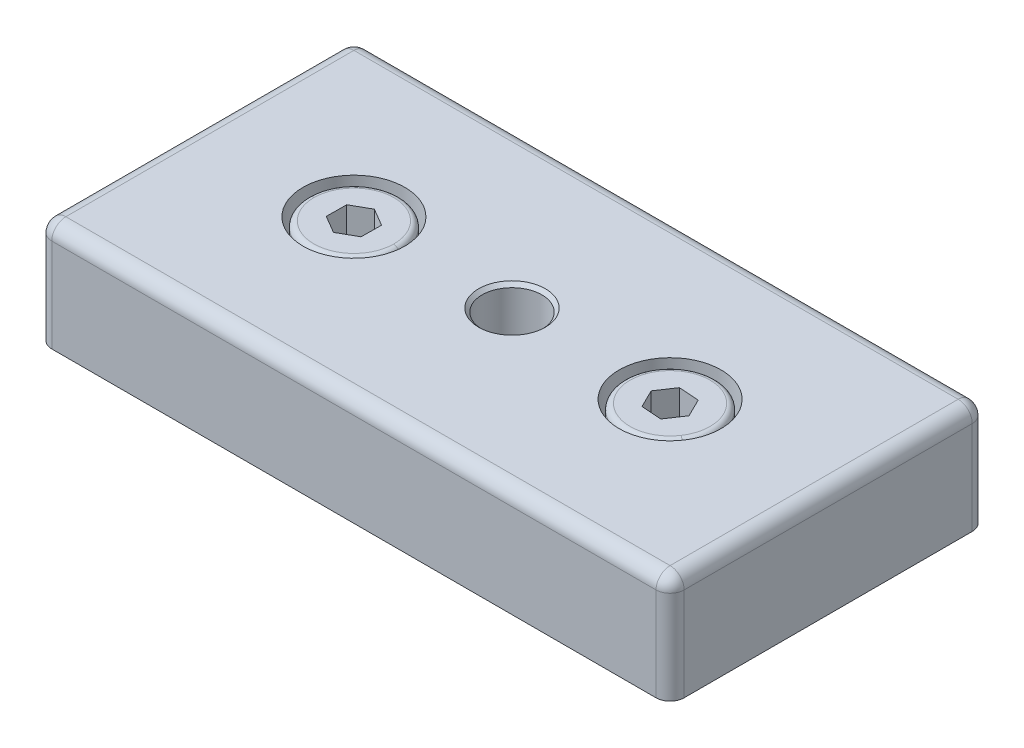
ISO-10303-21;
HEADER;
FILE_DESCRIPTION(('STEP AP214'),'2;1');
FILE_NAME('part.step','',(''),(''),'','','');
FILE_SCHEMA(('AUTOMOTIVE_DESIGN { 1 0 10303 214 1 1 1 1 }'));
ENDSEC;
DATA;
#1=APPLICATION_CONTEXT('core data for automotive mechanical design processes');
#2=APPLICATION_PROTOCOL_DEFINITION('international standard','automotive_design',2000,#1);
#3=PRODUCT_CONTEXT('',#1,'mechanical');
#4=PRODUCT('Part','Part','',(#3));
#5=PRODUCT_RELATED_PRODUCT_CATEGORY('part','',(#4));
#6=PRODUCT_DEFINITION_FORMATION('','',#4);
#7=PRODUCT_DEFINITION_CONTEXT('part definition',#1,'design');
#8=PRODUCT_DEFINITION('design','',#6,#7);
#9=PRODUCT_DEFINITION_SHAPE('','',#8);
#10=(LENGTH_UNIT() NAMED_UNIT(*) SI_UNIT(.MILLI.,.METRE.));
#11=(NAMED_UNIT(*) PLANE_ANGLE_UNIT() SI_UNIT($,.RADIAN.));
#12=(NAMED_UNIT(*) SI_UNIT($,.STERADIAN.) SOLID_ANGLE_UNIT());
#13=UNCERTAINTY_MEASURE_WITH_UNIT(LENGTH_MEASURE(1.E-05),#10,'distance_accuracy_value','');
#14=(GEOMETRIC_REPRESENTATION_CONTEXT(3) GLOBAL_UNCERTAINTY_ASSIGNED_CONTEXT((#13)) GLOBAL_UNIT_ASSIGNED_CONTEXT((#10,
#11,#12)) REPRESENTATION_CONTEXT('',''));
#15=CARTESIAN_POINT('',(0.,0.,0.));
#16=DIRECTION('',(0.,0.,1.));
#17=DIRECTION('',(1.,0.,0.));
#18=AXIS2_PLACEMENT_3D('',#15,#16,#17);
#19=CARTESIAN_POINT('',(-26.469565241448,6.42494993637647,0.00560986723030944));
#20=DIRECTION('',(0.,1.,0.));
#21=DIRECTION('',(-0.999963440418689,0.,-0.00855089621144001));
#22=AXIS2_PLACEMENT_3D('',#19,#20,#21);
#23=CONICAL_SURFACE('',#22,2.5,1.0471975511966);
#24=DIRECTION('',(0.86599374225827,0.5,0.00740529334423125));
#25=VECTOR('',#24,1.);
#26=CARTESIAN_POINT('',(-23.9696566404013,6.42494993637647,0.0269871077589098));
#27=LINE('',#26,#25);
#28=CARTESIAN_POINT('',(-26.469565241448,4.9815742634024,0.00560986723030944));
#29=VERTEX_POINT('',#28);
#30=CARTESIAN_POINT('',(-23.9696566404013,6.42494993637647,0.0269871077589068));
#31=VERTEX_POINT('',#30);
#32=EDGE_CURVE('P0_E333',#29,#31,#27,.T.);
#33=ORIENTED_EDGE('',*,*,#32,.F.);
#34=DIRECTION('',(-0.86599374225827,0.5,-0.00740529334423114));
#35=VECTOR('',#34,1.);
#36=CARTESIAN_POINT('',(-28.9694738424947,6.42494993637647,-0.0157673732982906));
#37=LINE('',#36,#35);
#38=CARTESIAN_POINT('',(-28.9694738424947,6.42494993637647,-0.015767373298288));
#39=VERTEX_POINT('',#38);
#40=EDGE_CURVE('P0_E336',#29,#39,#37,.T.);
#41=ORIENTED_EDGE('',*,*,#40,.T.);
#42=CARTESIAN_POINT('',(-26.469565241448,6.42494993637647,0.00560986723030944));
#43=DIRECTION('',(0.,1.,0.));
#44=DIRECTION('',(-0.999963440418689,0.,-0.00855089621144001));
#45=AXIS2_PLACEMENT_3D('',#42,#43,#44);
#46=CIRCLE('',#45,2.5);
#47=CARTESIAN_POINT('',(-27.7380327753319,6.42494993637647,2.15990560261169));
#48=VERTEX_POINT('',#47);
#49=EDGE_CURVE('P0_E10',#39,#48,#46,.T.);
#50=ORIENTED_EDGE('',*,*,#49,.T.);
#51=CARTESIAN_POINT('',(-26.469565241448,6.42494993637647,0.00560986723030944));
#52=DIRECTION('',(0.,1.,0.));
#53=DIRECTION('',(-0.999963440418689,0.,-0.00855089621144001));
#54=AXIS2_PLACEMENT_3D('',#51,#52,#53);
#55=CIRCLE('',#54,2.5);
#56=CARTESIAN_POINT('',(-25.2381241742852,6.42494993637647,2.18128284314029));
#57=VERTEX_POINT('',#56);
#58=EDGE_CURVE('P0_E26',#48,#57,#55,.T.);
#59=ORIENTED_EDGE('',*,*,#58,.T.);
#60=CARTESIAN_POINT('',(-26.469565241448,6.42494993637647,0.00560986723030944));
#61=DIRECTION('',(0.,1.,0.));
#62=DIRECTION('',(-0.999963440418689,0.,-0.00855089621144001));
#63=AXIS2_PLACEMENT_3D('',#60,#61,#62);
#64=CIRCLE('',#63,2.5);
#65=EDGE_CURVE('P0_E19',#57,#31,#64,.T.);
#66=ORIENTED_EDGE('',*,*,#65,.T.);
#67=EDGE_LOOP('',(#33,#41,#50,#59,#66));
#68=FACE_BOUND('',#67,.T.);
#69=ADVANCED_FACE('P0_F16',(#68),#23,.F.);
#70=CARTESIAN_POINT('',(-28.9818159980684,6.42494993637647,1.42755553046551));
#71=DIRECTION('',(0.,1.,0.));
#72=DIRECTION('',(-0.999963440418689,0.,-0.00855089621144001));
#73=AXIS2_PLACEMENT_3D('',#70,#71,#72);
#74=PLANE('',#73);
#75=ORIENTED_EDGE('',*,*,#49,.F.);
#76=DIRECTION('',(-0.00855089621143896,0.,0.999963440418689));
#77=VECTOR('',#76,1.);
#78=CARTESIAN_POINT('',(-28.957131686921,6.42494993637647,-1.45909027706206));
#79=LINE('',#78,#77);
#80=CARTESIAN_POINT('',(-28.9818159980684,6.42494993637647,1.42755553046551));
#81=VERTEX_POINT('',#80);
#82=EDGE_CURVE('P0_E294',#39,#81,#79,.T.);
#83=ORIENTED_EDGE('',*,*,#82,.T.);
#84=DIRECTION('',(-0.861718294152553,0.,-0.507387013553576));
#85=VECTOR('',#84,1.);
#86=CARTESIAN_POINT('',(-26.4942495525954,6.42494993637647,2.89225567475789));
#87=LINE('',#86,#85);
#88=EDGE_CURVE('P0_E275',#48,#81,#87,.T.);
#89=ORIENTED_EDGE('',*,*,#88,.F.);
#90=EDGE_LOOP('',(#75,#83,#89));
#91=FACE_BOUND('',#90,.T.);
#92=ADVANCED_FACE('P0_F598',(#91),#74,.T.);
#93=CARTESIAN_POINT('',(-28.9818159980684,6.42494993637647,1.42755553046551));
#94=DIRECTION('',(0.,1.,0.));
#95=DIRECTION('',(-0.999963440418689,0.,-0.00855089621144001));
#96=AXIS2_PLACEMENT_3D('',#93,#94,#95);
#97=PLANE('',#96);
#98=ORIENTED_EDGE('',*,*,#58,.F.);
#99=DIRECTION('',(-0.861718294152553,0.,-0.507387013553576));
#100=VECTOR('',#99,1.);
#101=CARTESIAN_POINT('',(-26.4942495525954,6.42494993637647,2.89225567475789));
#102=LINE('',#101,#100);
#103=CARTESIAN_POINT('',(-26.4942495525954,6.42494993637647,2.89225567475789));
#104=VERTEX_POINT('',#103);
#105=EDGE_CURVE('P0_E271',#104,#48,#102,.T.);
#106=ORIENTED_EDGE('',*,*,#105,.F.);
#107=DIRECTION('',(0.870269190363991,0.,-0.492576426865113));
#108=VECTOR('',#107,1.);
#109=CARTESIAN_POINT('',(-26.4942495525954,6.42494993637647,2.89225567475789));
#110=LINE('',#109,#108);
#111=EDGE_CURVE('P0_E207',#104,#57,#110,.T.);
#112=ORIENTED_EDGE('',*,*,#111,.T.);
#113=EDGE_LOOP('',(#98,#106,#112));
#114=FACE_BOUND('',#113,.T.);
#115=ADVANCED_FACE('P0_F599',(#114),#97,.T.);
#116=CARTESIAN_POINT('',(-28.9818159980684,6.42494993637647,1.42755553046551));
#117=DIRECTION('',(0.,1.,0.));
#118=DIRECTION('',(-0.999963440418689,0.,-0.00855089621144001));
#119=AXIS2_PLACEMENT_3D('',#116,#117,#118);
#120=PLANE('',#119);
#121=ORIENTED_EDGE('',*,*,#65,.F.);
#122=DIRECTION('',(0.870269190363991,0.,-0.492576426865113));
#123=VECTOR('',#122,1.);
#124=CARTESIAN_POINT('',(-26.4942495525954,6.42494993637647,2.89225567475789));
#125=LINE('',#124,#123);
#126=CARTESIAN_POINT('',(-23.981998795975,6.42494993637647,1.4703100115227));
#127=VERTEX_POINT('',#126);
#128=EDGE_CURVE('P0_E205',#57,#127,#125,.T.);
#129=ORIENTED_EDGE('',*,*,#128,.T.);
#130=DIRECTION('',(0.00855089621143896,0.,-0.999963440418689));
#131=VECTOR('',#130,1.);
#132=CARTESIAN_POINT('',(-23.981998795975,6.42494993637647,1.4703100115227));
#133=LINE('',#132,#131);
#134=EDGE_CURVE('P0_E175',#127,#31,#133,.T.);
#135=ORIENTED_EDGE('',*,*,#134,.T.);
#136=EDGE_LOOP('',(#121,#129,#135));
#137=FACE_BOUND('',#136,.T.);
#138=ADVANCED_FACE('P0_F609',(#137),#120,.T.);
#139=CARTESIAN_POINT('',(-28.9818159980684,6.42494993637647,1.42755553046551));
#140=DIRECTION('',(0.,1.,0.));
#141=DIRECTION('',(-0.999963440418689,0.,-0.00855089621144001));
#142=AXIS2_PLACEMENT_3D('',#139,#140,#141);
#143=PLANE('',#142);
#144=CARTESIAN_POINT('',(-26.469565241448,6.42494993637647,0.00560986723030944));
#145=DIRECTION('',(0.,1.,0.));
#146=DIRECTION('',(-0.999963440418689,0.,-0.00855089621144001));
#147=AXIS2_PLACEMENT_3D('',#144,#145,#146);
#148=CIRCLE('',#147,2.5);
#149=CARTESIAN_POINT('',(-25.201097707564,6.42494993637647,-2.14868586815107));
#150=VERTEX_POINT('',#149);
#151=EDGE_CURVE('P0_E170',#31,#150,#148,.T.);
#152=ORIENTED_EDGE('',*,*,#151,.F.);
#153=DIRECTION('',(0.00855089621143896,0.,-0.999963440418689));
#154=VECTOR('',#153,1.);
#155=CARTESIAN_POINT('',(-23.981998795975,6.42494993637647,1.4703100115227));
#156=LINE('',#155,#154);
#157=CARTESIAN_POINT('',(-23.9573144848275,6.42494993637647,-1.41633579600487));
#158=VERTEX_POINT('',#157);
#159=EDGE_CURVE('P0_E163',#31,#158,#156,.T.);
#160=ORIENTED_EDGE('',*,*,#159,.T.);
#161=DIRECTION('',(0.861718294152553,0.,0.507387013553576));
#162=VECTOR('',#161,1.);
#163=CARTESIAN_POINT('',(-26.4448809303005,6.42494993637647,-2.88103594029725));
#164=LINE('',#163,#162);
#165=EDGE_CURVE('P0_E167',#150,#158,#164,.T.);
#166=ORIENTED_EDGE('',*,*,#165,.F.);
#167=EDGE_LOOP('',(#152,#160,#166));
#168=FACE_BOUND('',#167,.T.);
#169=ADVANCED_FACE('P0_F165',(#168),#143,.T.);
#170=CARTESIAN_POINT('',(-28.9818159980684,6.42494993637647,1.42755553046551));
#171=DIRECTION('',(0.,1.,0.));
#172=DIRECTION('',(-0.999963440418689,0.,-0.00855089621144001));
#173=AXIS2_PLACEMENT_3D('',#170,#171,#172);
#174=PLANE('',#173);
#175=CARTESIAN_POINT('',(-26.469565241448,6.42494993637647,0.00560986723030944));
#176=DIRECTION('',(0.,1.,0.));
#177=DIRECTION('',(-0.999963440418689,0.,-0.00855089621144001));
#178=AXIS2_PLACEMENT_3D('',#175,#176,#177);
#179=CIRCLE('',#178,2.5);
#180=CARTESIAN_POINT('',(-27.7010063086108,6.42494993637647,-2.17006310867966));
#181=VERTEX_POINT('',#180);
#182=EDGE_CURVE('P0_E317',#150,#181,#179,.T.);
#183=ORIENTED_EDGE('',*,*,#182,.F.);
#184=DIRECTION('',(0.861718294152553,0.,0.507387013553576));
#185=VECTOR('',#184,1.);
#186=CARTESIAN_POINT('',(-26.4448809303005,6.42494993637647,-2.88103594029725));
#187=LINE('',#186,#185);
#188=CARTESIAN_POINT('',(-26.4448809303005,6.42494993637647,-2.88103594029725));
#189=VERTEX_POINT('',#188);
#190=EDGE_CURVE('P0_E189',#189,#150,#187,.T.);
#191=ORIENTED_EDGE('',*,*,#190,.F.);
#192=DIRECTION('',(0.870269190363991,0.,-0.492576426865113));
#193=VECTOR('',#192,1.);
#194=CARTESIAN_POINT('',(-28.957131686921,6.42494993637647,-1.45909027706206));
#195=LINE('',#194,#193);
#196=EDGE_CURVE('P0_E291',#181,#189,#195,.T.);
#197=ORIENTED_EDGE('',*,*,#196,.F.);
#198=EDGE_LOOP('',(#183,#191,#197));
#199=FACE_BOUND('',#198,.T.);
#200=ADVANCED_FACE('P0_F315',(#199),#174,.T.);
#201=CARTESIAN_POINT('',(-28.9818159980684,6.42494993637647,1.42755553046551));
#202=DIRECTION('',(0.,1.,0.));
#203=DIRECTION('',(-0.999963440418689,0.,-0.00855089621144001));
#204=AXIS2_PLACEMENT_3D('',#201,#202,#203);
#205=PLANE('',#204);
#206=CARTESIAN_POINT('',(-26.469565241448,6.42494993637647,0.00560986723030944));
#207=DIRECTION('',(0.,1.,0.));
#208=DIRECTION('',(-0.999963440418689,0.,-0.00855089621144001));
#209=AXIS2_PLACEMENT_3D('',#206,#207,#208);
#210=CIRCLE('',#209,2.5);
#211=EDGE_CURVE('P0_E344',#181,#39,#210,.T.);
#212=ORIENTED_EDGE('',*,*,#211,.F.);
#213=DIRECTION('',(0.870269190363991,0.,-0.492576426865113));
#214=VECTOR('',#213,1.);
#215=CARTESIAN_POINT('',(-28.957131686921,6.42494993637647,-1.45909027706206));
#216=LINE('',#215,#214);
#217=CARTESIAN_POINT('',(-28.957131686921,6.42494993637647,-1.45909027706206));
#218=VERTEX_POINT('',#217);
#219=EDGE_CURVE('P0_E302',#218,#181,#216,.T.);
#220=ORIENTED_EDGE('',*,*,#219,.F.);
#221=DIRECTION('',(-0.00855089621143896,0.,0.999963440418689));
#222=VECTOR('',#221,1.);
#223=CARTESIAN_POINT('',(-28.957131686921,6.42494993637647,-1.45909027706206));
#224=LINE('',#223,#222);
#225=EDGE_CURVE('P0_E297',#218,#39,#224,.T.);
#226=ORIENTED_EDGE('',*,*,#225,.T.);
#227=EDGE_LOOP('',(#212,#220,#226));
#228=FACE_BOUND('',#227,.T.);
#229=ADVANCED_FACE('P0_F590',(#228),#205,.T.);
#230=CARTESIAN_POINT('',(-26.4942495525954,6.42494993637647,2.89225567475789));
#231=DIRECTION('',(0.492576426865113,0.,0.870269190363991));
#232=DIRECTION('',(0.,1.,0.));
#233=AXIS2_PLACEMENT_3D('',#230,#231,#232);
#234=PLANE('',#233);
#235=DIRECTION('',(0.870269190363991,0.,-0.492576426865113));
#236=VECTOR('',#235,1.);
#237=CARTESIAN_POINT('',(-26.4942495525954,10.2249499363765,2.89225567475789));
#238=LINE('',#237,#236);
#239=CARTESIAN_POINT('',(-26.4942495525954,10.2249499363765,2.89225567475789));
#240=VERTEX_POINT('',#239);
#241=CARTESIAN_POINT('',(-23.981998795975,10.2249499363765,1.4703100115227));
#242=VERTEX_POINT('',#241);
#243=EDGE_CURVE('P0_E260',#240,#242,#238,.T.);
#244=ORIENTED_EDGE('',*,*,#243,.T.);
#245=DIRECTION('',(0.,1.,0.));
#246=VECTOR('',#245,1.);
#247=CARTESIAN_POINT('',(-23.981998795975,6.42494993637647,1.4703100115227));
#248=LINE('',#247,#246);
#249=EDGE_CURVE('P0_E203',#127,#242,#248,.T.);
#250=ORIENTED_EDGE('',*,*,#249,.F.);
#251=ORIENTED_EDGE('',*,*,#128,.F.);
#252=ORIENTED_EDGE('',*,*,#111,.F.);
#253=DIRECTION('',(0.,1.,0.));
#254=VECTOR('',#253,1.);
#255=CARTESIAN_POINT('',(-26.4942495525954,6.42494993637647,2.89225567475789));
#256=LINE('',#255,#254);
#257=EDGE_CURVE('P0_E276',#104,#240,#256,.T.);
#258=ORIENTED_EDGE('',*,*,#257,.T.);
#259=EDGE_LOOP('',(#244,#250,#251,#252,#258));
#260=FACE_BOUND('',#259,.T.);
#261=ADVANCED_FACE('P0_F606',(#260),#234,.F.);
#262=CARTESIAN_POINT('',(-23.981998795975,6.42494993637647,1.4703100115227));
#263=DIRECTION('',(0.999963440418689,0.,0.00855089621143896));
#264=DIRECTION('',(0.00855089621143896,0.,-0.999963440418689));
#265=AXIS2_PLACEMENT_3D('',#262,#263,#264);
#266=PLANE('',#265);
#267=DIRECTION('',(0.00855089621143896,0.,-0.999963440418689));
#268=VECTOR('',#267,1.);
#269=CARTESIAN_POINT('',(-23.981998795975,10.2249499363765,1.4703100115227));
#270=LINE('',#269,#268);
#271=CARTESIAN_POINT('',(-23.9573144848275,10.2249499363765,-1.41633579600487));
#272=VERTEX_POINT('',#271);
#273=EDGE_CURVE('P0_E181',#242,#272,#270,.T.);
#274=ORIENTED_EDGE('',*,*,#273,.T.);
#275=DIRECTION('',(0.,1.,0.));
#276=VECTOR('',#275,1.);
#277=CARTESIAN_POINT('',(-23.9573144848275,6.42494993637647,-1.41633579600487));
#278=LINE('',#277,#276);
#279=EDGE_CURVE('P0_E176',#158,#272,#278,.T.);
#280=ORIENTED_EDGE('',*,*,#279,.F.);
#281=ORIENTED_EDGE('',*,*,#159,.F.);
#282=ORIENTED_EDGE('',*,*,#134,.F.);
#283=ORIENTED_EDGE('',*,*,#249,.T.);
#284=EDGE_LOOP('',(#274,#280,#281,#282,#283));
#285=FACE_BOUND('',#284,.T.);
#286=ADVANCED_FACE('P0_F179',(#285),#266,.F.);
#287=CARTESIAN_POINT('',(-26.4448809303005,6.42494993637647,-2.88103594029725));
#288=DIRECTION('',(-0.507387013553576,0.,0.861718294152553));
#289=DIRECTION('',(0.,-1.,0.));
#290=AXIS2_PLACEMENT_3D('',#287,#288,#289);
#291=PLANE('',#290);
#292=DIRECTION('',(0.861718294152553,0.,0.507387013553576));
#293=VECTOR('',#292,1.);
#294=CARTESIAN_POINT('',(-26.4448809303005,10.2249499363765,-2.88103594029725));
#295=LINE('',#294,#293);
#296=CARTESIAN_POINT('',(-26.4448809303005,10.2249499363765,-2.88103594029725));
#297=VERTEX_POINT('',#296);
#298=EDGE_CURVE('P0_E254',#297,#272,#295,.T.);
#299=ORIENTED_EDGE('',*,*,#298,.F.);
#300=DIRECTION('',(0.,1.,0.));
#301=VECTOR('',#300,1.);
#302=CARTESIAN_POINT('',(-26.4448809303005,6.42494993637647,-2.88103594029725));
#303=LINE('',#302,#301);
#304=EDGE_CURVE('P0_E197',#189,#297,#303,.T.);
#305=ORIENTED_EDGE('',*,*,#304,.F.);
#306=ORIENTED_EDGE('',*,*,#190,.T.);
#307=ORIENTED_EDGE('',*,*,#165,.T.);
#308=ORIENTED_EDGE('',*,*,#279,.T.);
#309=EDGE_LOOP('',(#299,#305,#306,#307,#308));
#310=FACE_BOUND('',#309,.T.);
#311=ADVANCED_FACE('P0_F187',(#310),#291,.T.);
#312=CARTESIAN_POINT('',(-28.957131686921,6.42494993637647,-1.45909027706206));
#313=DIRECTION('',(0.492576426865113,0.,0.870269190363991));
#314=DIRECTION('',(0.,1.,0.));
#315=AXIS2_PLACEMENT_3D('',#312,#313,#314);
#316=PLANE('',#315);
#317=DIRECTION('',(0.870269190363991,0.,-0.492576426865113));
#318=VECTOR('',#317,1.);
#319=CARTESIAN_POINT('',(-28.957131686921,10.2249499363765,-1.45909027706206));
#320=LINE('',#319,#318);
#321=CARTESIAN_POINT('',(-28.957131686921,10.2249499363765,-1.45909027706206));
#322=VERTEX_POINT('',#321);
#323=EDGE_CURVE('P0_E257',#322,#297,#320,.T.);
#324=ORIENTED_EDGE('',*,*,#323,.F.);
#325=DIRECTION('',(0.,1.,0.));
#326=VECTOR('',#325,1.);
#327=CARTESIAN_POINT('',(-28.957131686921,6.42494993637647,-1.45909027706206));
#328=LINE('',#327,#326);
#329=EDGE_CURVE('P0_E301',#218,#322,#328,.T.);
#330=ORIENTED_EDGE('',*,*,#329,.F.);
#331=ORIENTED_EDGE('',*,*,#219,.T.);
#332=ORIENTED_EDGE('',*,*,#196,.T.);
#333=ORIENTED_EDGE('',*,*,#304,.T.);
#334=EDGE_LOOP('',(#324,#330,#331,#332,#333));
#335=FACE_BOUND('',#334,.T.);
#336=ADVANCED_FACE('P0_F311',(#335),#316,.T.);
#337=CARTESIAN_POINT('',(-28.957131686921,6.42494993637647,-1.45909027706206));
#338=DIRECTION('',(-0.999963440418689,0.,-0.00855089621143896));
#339=DIRECTION('',(0.00855089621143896,0.,-0.999963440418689));
#340=AXIS2_PLACEMENT_3D('',#337,#338,#339);
#341=PLANE('',#340);
#342=DIRECTION('',(-0.00855089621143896,0.,0.999963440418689));
#343=VECTOR('',#342,1.);
#344=CARTESIAN_POINT('',(-28.957131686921,10.2249499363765,-1.45909027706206));
#345=LINE('',#344,#343);
#346=CARTESIAN_POINT('',(-28.9818159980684,10.2249499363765,1.42755553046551));
#347=VERTEX_POINT('',#346);
#348=EDGE_CURVE('P0_E251',#322,#347,#345,.T.);
#349=ORIENTED_EDGE('',*,*,#348,.T.);
#350=DIRECTION('',(0.,1.,0.));
#351=VECTOR('',#350,1.);
#352=CARTESIAN_POINT('',(-28.9818159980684,6.42494993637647,1.42755553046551));
#353=LINE('',#352,#351);
#354=EDGE_CURVE('P0_E288',#81,#347,#353,.T.);
#355=ORIENTED_EDGE('',*,*,#354,.F.);
#356=ORIENTED_EDGE('',*,*,#82,.F.);
#357=ORIENTED_EDGE('',*,*,#225,.F.);
#358=ORIENTED_EDGE('',*,*,#329,.T.);
#359=EDGE_LOOP('',(#349,#355,#356,#357,#358));
#360=FACE_BOUND('',#359,.T.);
#361=ADVANCED_FACE('P0_F595',(#360),#341,.F.);
#362=CARTESIAN_POINT('',(-26.4942495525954,6.42494993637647,2.89225567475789));
#363=DIRECTION('',(0.507387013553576,0.,-0.861718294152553));
#364=DIRECTION('',(0.861718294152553,0.,0.507387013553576));
#365=AXIS2_PLACEMENT_3D('',#362,#363,#364);
#366=PLANE('',#365);
#367=DIRECTION('',(-0.861718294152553,0.,-0.507387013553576));
#368=VECTOR('',#367,1.);
#369=CARTESIAN_POINT('',(-26.4942495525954,10.2249499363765,2.89225567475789));
#370=LINE('',#369,#368);
#371=EDGE_CURVE('P0_E247',#240,#347,#370,.T.);
#372=ORIENTED_EDGE('',*,*,#371,.F.);
#373=ORIENTED_EDGE('',*,*,#257,.F.);
#374=ORIENTED_EDGE('',*,*,#105,.T.);
#375=ORIENTED_EDGE('',*,*,#88,.T.);
#376=ORIENTED_EDGE('',*,*,#354,.T.);
#377=EDGE_LOOP('',(#372,#373,#374,#375,#376));
#378=FACE_BOUND('',#377,.T.);
#379=ADVANCED_FACE('P0_F603',(#378),#366,.T.);
#380=CARTESIAN_POINT('',(-26.469565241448,9.42494993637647,0.00560986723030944));
#381=DIRECTION('',(0.,1.,0.));
#382=DIRECTION('',(-0.999963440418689,0.,-0.00855089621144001));
#383=AXIS2_PLACEMENT_3D('',#380,#381,#382);
#384=TOROIDAL_SURFACE('',#383,5.7,0.8);
#385=CARTESIAN_POINT('',(-20.7697736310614,9.42494993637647,0.0543499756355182));
#386=DIRECTION('',(-0.00855089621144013,0.,0.999963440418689));
#387=DIRECTION('',(-0.999963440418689,0.,-0.00855089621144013));
#388=AXIS2_PLACEMENT_3D('',#385,#386,#387);
#389=CIRCLE('',#388,0.8);
#390=CARTESIAN_POINT('',(-19.9698028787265,9.42494993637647,0.0611906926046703));
#391=VERTEX_POINT('',#390);
#392=CARTESIAN_POINT('',(-20.7697736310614,10.2249499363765,0.0543499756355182));
#393=VERTEX_POINT('',#392);
#394=EDGE_CURVE('P0_E343',#391,#393,#389,.T.);
#395=ORIENTED_EDGE('',*,*,#394,.F.);
#396=CARTESIAN_POINT('',(-26.469565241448,9.42494993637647,0.00560986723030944));
#397=DIRECTION('',(0.,-1.,0.));
#398=DIRECTION('',(-0.999963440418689,0.,-0.00855089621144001));
#399=AXIS2_PLACEMENT_3D('',#396,#397,#398);
#400=CIRCLE('',#399,6.5);
#401=CARTESIAN_POINT('',(-32.9693276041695,9.42494993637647,-0.0499709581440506));
#402=VERTEX_POINT('',#401);
#403=EDGE_CURVE('P0_E267',#402,#391,#400,.T.);
#404=ORIENTED_EDGE('',*,*,#403,.F.);
#405=CARTESIAN_POINT('',(-32.1693568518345,9.42494993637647,-0.0431302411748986));
#406=DIRECTION('',(0.00855089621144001,0.,-0.999963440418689));
#407=DIRECTION('',(0.999963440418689,0.,0.00855089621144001));
#408=AXIS2_PLACEMENT_3D('',#405,#406,#407);
#409=CIRCLE('',#408,0.8);
#410=CARTESIAN_POINT('',(-32.1693568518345,10.2249499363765,-0.0431302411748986));
#411=VERTEX_POINT('',#410);
#412=EDGE_CURVE('P0_E362',#402,#411,#409,.T.);
#413=ORIENTED_EDGE('',*,*,#412,.T.);
#414=CARTESIAN_POINT('',(-26.469565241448,10.2249499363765,0.00560986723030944));
#415=DIRECTION('',(0.,1.,0.));
#416=DIRECTION('',(-0.999963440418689,0.,-0.00855089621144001));
#417=AXIS2_PLACEMENT_3D('',#414,#415,#416);
#418=CIRCLE('',#417,5.7);
#419=EDGE_CURVE('P0_E244',#393,#411,#418,.T.);
#420=ORIENTED_EDGE('',*,*,#419,.F.);
#421=EDGE_LOOP('',(#395,#404,#413,#420));
#422=FACE_BOUND('',#421,.T.);
#423=ADVANCED_FACE('P0_F640',(#422),#384,.T.);
#424=CARTESIAN_POINT('',(-26.469565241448,4.82494993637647,0.00560986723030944));
#425=DIRECTION('',(0.,-1.,0.));
#426=DIRECTION('',(0.999963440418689,0.,0.00855089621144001));
#427=AXIS2_PLACEMENT_3D('',#424,#425,#426);
#428=TOROIDAL_SURFACE('',#427,4.39999999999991,0.4);
#429=CARTESIAN_POINT('',(-30.8694043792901,4.82494993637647,-0.0320140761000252));
#430=DIRECTION('',(-0.00855089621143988,0.,0.999963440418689));
#431=DIRECTION('',(-0.999963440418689,0.,-0.00855089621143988));
#432=AXIS2_PLACEMENT_3D('',#429,#430,#431);
#433=CIRCLE('',#432,0.4);
#434=CARTESIAN_POINT('',(-30.4694190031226,4.82494993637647,-0.0285937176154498));
#435=VERTEX_POINT('',#434);
#436=CARTESIAN_POINT('',(-30.8694043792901,5.22494993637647,-0.0320140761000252));
#437=VERTEX_POINT('',#436);
#438=EDGE_CURVE('P0_E372',#435,#437,#433,.T.);
#439=ORIENTED_EDGE('',*,*,#438,.F.);
#440=CARTESIAN_POINT('',(-26.469565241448,4.82494993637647,0.00560986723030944));
#441=DIRECTION('',(0.,-1.,0.));
#442=DIRECTION('',(0.999963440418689,0.,0.00855089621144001));
#443=AXIS2_PLACEMENT_3D('',#440,#441,#442);
#444=CIRCLE('',#443,3.99999999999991);
#445=CARTESIAN_POINT('',(-22.4697114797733,4.82494993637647,0.0398134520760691));
#446=VERTEX_POINT('',#445);
#447=EDGE_CURVE('P0_E227',#446,#435,#444,.T.);
#448=ORIENTED_EDGE('',*,*,#447,.F.);
#449=CARTESIAN_POINT('',(-22.0697261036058,4.82494993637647,0.0432338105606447));
#450=DIRECTION('',(0.00855089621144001,0.,-0.999963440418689));
#451=DIRECTION('',(0.999963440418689,0.,0.00855089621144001));
#452=AXIS2_PLACEMENT_3D('',#449,#450,#451);
#453=CIRCLE('',#452,0.4);
#454=CARTESIAN_POINT('',(-22.0697261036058,5.22494993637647,0.0432338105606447));
#455=VERTEX_POINT('',#454);
#456=EDGE_CURVE('P0_E354',#446,#455,#453,.T.);
#457=ORIENTED_EDGE('',*,*,#456,.T.);
#458=CARTESIAN_POINT('',(-26.469565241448,5.22494993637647,0.00560986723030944));
#459=DIRECTION('',(0.,1.,0.));
#460=DIRECTION('',(0.999963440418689,0.,0.00855089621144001));
#461=AXIS2_PLACEMENT_3D('',#458,#459,#460);
#462=CIRCLE('',#461,4.39999999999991);
#463=EDGE_CURVE('P0_E270',#437,#455,#462,.T.);
#464=ORIENTED_EDGE('',*,*,#463,.F.);
#465=EDGE_LOOP('',(#439,#448,#457,#464));
#466=FACE_BOUND('',#465,.T.);
#467=ADVANCED_FACE('P0_F643',(#466),#428,.F.);
#468=CARTESIAN_POINT('',(-26.4978644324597,-19.7750500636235,3.31498887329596));
#469=DIRECTION('',(0.,-1.,0.));
#470=DIRECTION('',(-0.00855089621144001,0.,0.999963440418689));
#471=AXIS2_PLACEMENT_3D('',#468,#469,#470);
#472=PLANE('',#471);
#473=CARTESIAN_POINT('',(-26.469565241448,-19.7750500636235,0.00560986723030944));
#474=DIRECTION('',(0.,1.,0.));
#475=DIRECTION('',(-0.999963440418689,0.,-0.00855089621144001));
#476=AXIS2_PLACEMENT_3D('',#473,#474,#475);
#477=CIRCLE('',#476,3.3095);
#478=CARTESIAN_POINT('',(-29.7789442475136,-19.7750500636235,-0.0226893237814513));
#479=VERTEX_POINT('',#478);
#480=CARTESIAN_POINT('',(-23.1601862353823,-19.7750500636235,0.0339090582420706));
#481=VERTEX_POINT('',#480);
#482=EDGE_CURVE('P0_E350',#479,#481,#477,.T.);
#483=ORIENTED_EDGE('',*,*,#482,.F.);
#484=CARTESIAN_POINT('',(-26.469565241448,-19.7750500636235,0.00560986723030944));
#485=DIRECTION('',(0.,1.,0.));
#486=DIRECTION('',(-0.999963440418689,0.,-0.00855089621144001));
#487=AXIS2_PLACEMENT_3D('',#484,#485,#486);
#488=CIRCLE('',#487,3.3095);
#489=EDGE_CURVE('P0_E280',#481,#479,#488,.T.);
#490=ORIENTED_EDGE('',*,*,#489,.F.);
#491=EDGE_LOOP('',(#483,#490));
#492=FACE_BOUND('',#491,.T.);
#493=ADVANCED_FACE('P0_F649',(#492),#472,.T.);
#494=CARTESIAN_POINT('',(-26.469565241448,-19.7750500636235,0.00560986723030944));
#495=DIRECTION('',(0.,1.,0.));
#496=DIRECTION('',(-0.999963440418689,0.,-0.00855089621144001));
#497=AXIS2_PLACEMENT_3D('',#494,#495,#496);
#498=CONICAL_SURFACE('',#497,3.3095,0.785398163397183);
#499=DIRECTION('',(0.707080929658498,0.707106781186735,0.00604639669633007));
#500=VECTOR('',#499,1.);
#501=CARTESIAN_POINT('',(-23.1601862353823,-19.7750500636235,0.0339090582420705));
#502=LINE('',#501,#500);
#503=CARTESIAN_POINT('',(-22.4697114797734,-19.0845500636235,0.0398134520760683));
#504=VERTEX_POINT('',#503);
#505=EDGE_CURVE('P0_E345',#481,#504,#502,.T.);
#506=ORIENTED_EDGE('',*,*,#505,.F.);
#507=ORIENTED_EDGE('',*,*,#489,.T.);
#508=DIRECTION('',(-0.707080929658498,0.707106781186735,-0.00604639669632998));
#509=VECTOR('',#508,1.);
#510=CARTESIAN_POINT('',(-29.7789442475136,-19.7750500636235,-0.0226893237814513));
#511=LINE('',#510,#509);
#512=CARTESIAN_POINT('',(-30.4694190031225,-19.0845500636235,-0.028593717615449));
#513=VERTEX_POINT('',#512);
#514=EDGE_CURVE('P0_E384',#479,#513,#511,.T.);
#515=ORIENTED_EDGE('',*,*,#514,.T.);
#516=CARTESIAN_POINT('',(-26.469565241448,-19.0845500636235,0.00560986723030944));
#517=DIRECTION('',(0.,1.,0.));
#518=DIRECTION('',(-0.999963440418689,0.,-0.00855089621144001));
#519=AXIS2_PLACEMENT_3D('',#516,#517,#518);
#520=CIRCLE('',#519,3.99999999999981);
#521=EDGE_CURVE('P0_E277',#504,#513,#520,.T.);
#522=ORIENTED_EDGE('',*,*,#521,.F.);
#523=EDGE_LOOP('',(#506,#507,#515,#522));
#524=FACE_BOUND('',#523,.T.);
#525=ADVANCED_FACE('P0_F653',(#524),#498,.T.);
#526=CARTESIAN_POINT('',(-26.469565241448,41.9749499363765,0.00560986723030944));
#527=DIRECTION('',(0.,1.,0.));
#528=DIRECTION('',(-0.999963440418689,0.,-0.00855089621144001));
#529=AXIS2_PLACEMENT_3D('',#526,#527,#528);
#530=CYLINDRICAL_SURFACE('',#529,3.99999999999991);
#531=DIRECTION('',(0.,1.,0.));
#532=VECTOR('',#531,1.);
#533=CARTESIAN_POINT('',(-22.4697114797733,41.9749499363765,0.0398134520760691));
#534=LINE('',#533,#532);
#535=EDGE_CURVE('P0_E225',#504,#446,#534,.T.);
#536=ORIENTED_EDGE('',*,*,#535,.F.);
#537=ORIENTED_EDGE('',*,*,#521,.T.);
#538=DIRECTION('',(0.,1.,0.));
#539=VECTOR('',#538,1.);
#540=CARTESIAN_POINT('',(-30.4694190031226,41.9749499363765,-0.0285937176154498));
#541=LINE('',#540,#539);
#542=EDGE_CURVE('P0_E231',#513,#435,#541,.T.);
#543=ORIENTED_EDGE('',*,*,#542,.T.);
#544=CARTESIAN_POINT('',(-26.469565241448,4.82494993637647,0.00560986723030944));
#545=DIRECTION('',(0.,-1.,0.));
#546=DIRECTION('',(0.999963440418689,0.,0.00855089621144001));
#547=AXIS2_PLACEMENT_3D('',#544,#545,#546);
#548=CIRCLE('',#547,3.99999999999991);
#549=EDGE_CURVE('P0_E366',#435,#446,#548,.T.);
#550=ORIENTED_EDGE('',*,*,#549,.T.);
#551=EDGE_LOOP('',(#536,#537,#543,#550));
#552=FACE_BOUND('',#551,.T.);
#553=ADVANCED_FACE('P0_F414',(#552),#530,.T.);
#554=CARTESIAN_POINT('',(-26.5251460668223,5.22494993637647,6.50537222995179));
#555=DIRECTION('',(0.,-1.,0.));
#556=DIRECTION('',(-0.00855089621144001,0.,0.999963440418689));
#557=AXIS2_PLACEMENT_3D('',#554,#555,#556);
#558=PLANE('',#557);
#559=CARTESIAN_POINT('',(-26.469565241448,5.22494993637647,0.00560986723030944));
#560=DIRECTION('',(0.,1.,0.));
#561=DIRECTION('',(0.999963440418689,0.,0.00855089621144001));
#562=AXIS2_PLACEMENT_3D('',#559,#560,#561);
#563=CIRCLE('',#562,4.39999999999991);
#564=EDGE_CURVE('P0_E376',#455,#437,#563,.T.);
#565=ORIENTED_EDGE('',*,*,#564,.T.);
#566=ORIENTED_EDGE('',*,*,#463,.T.);
#567=EDGE_LOOP('',(#565,#566));
#568=FACE_BOUND('',#567,.T.);
#569=CARTESIAN_POINT('',(-26.469565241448,5.22494993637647,0.00560986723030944));
#570=DIRECTION('',(0.,1.,0.));
#571=DIRECTION('',(-0.999963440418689,0.,-0.00855089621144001));
#572=AXIS2_PLACEMENT_3D('',#569,#570,#571);
#573=CIRCLE('',#572,6.5);
#574=CARTESIAN_POINT('',(-32.9693276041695,5.22494993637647,-0.0499709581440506));
#575=VERTEX_POINT('',#574);
#576=CARTESIAN_POINT('',(-19.9698028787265,5.22494993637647,0.0611906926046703));
#577=VERTEX_POINT('',#576);
#578=EDGE_CURVE('P0_E235',#575,#577,#573,.T.);
#579=ORIENTED_EDGE('',*,*,#578,.F.);
#580=CARTESIAN_POINT('',(-26.469565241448,5.22494993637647,0.00560986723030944));
#581=DIRECTION('',(0.,1.,0.));
#582=DIRECTION('',(-0.999963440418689,0.,-0.00855089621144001));
#583=AXIS2_PLACEMENT_3D('',#580,#581,#582);
#584=CIRCLE('',#583,6.5);
#585=EDGE_CURVE('P0_E264',#577,#575,#584,.T.);
#586=ORIENTED_EDGE('',*,*,#585,.F.);
#587=EDGE_LOOP('',(#579,#586));
#588=FACE_BOUND('',#587,.T.);
#589=ADVANCED_FACE('P0_F659',(#568,#588),#558,.T.);
#590=CARTESIAN_POINT('',(-26.469565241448,41.9749499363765,0.00560986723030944));
#591=DIRECTION('',(0.,1.,0.));
#592=DIRECTION('',(-0.999963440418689,0.,-0.00855089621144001));
#593=AXIS2_PLACEMENT_3D('',#590,#591,#592);
#594=CYLINDRICAL_SURFACE('',#593,6.5);
#595=DIRECTION('',(0.,1.,0.));
#596=VECTOR('',#595,1.);
#597=CARTESIAN_POINT('',(-19.9698028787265,41.9749499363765,0.0611906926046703));
#598=LINE('',#597,#596);
#599=EDGE_CURVE('P0_E236',#577,#391,#598,.T.);
#600=ORIENTED_EDGE('',*,*,#599,.F.);
#601=ORIENTED_EDGE('',*,*,#585,.T.);
#602=DIRECTION('',(0.,1.,0.));
#603=VECTOR('',#602,1.);
#604=CARTESIAN_POINT('',(-32.9693276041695,41.9749499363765,-0.0499709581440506));
#605=LINE('',#604,#603);
#606=EDGE_CURVE('P0_E240',#575,#402,#605,.T.);
#607=ORIENTED_EDGE('',*,*,#606,.T.);
#608=ORIENTED_EDGE('',*,*,#403,.T.);
#609=EDGE_LOOP('',(#600,#601,#607,#608));
#610=FACE_BOUND('',#609,.T.);
#611=ADVANCED_FACE('P0_F662',(#610),#594,.T.);
#612=CARTESIAN_POINT('',(-26.469565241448,10.2249499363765,0.00560986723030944));
#613=DIRECTION('',(0.,1.,0.));
#614=DIRECTION('',(-0.999963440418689,0.,-0.00855089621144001));
#615=AXIS2_PLACEMENT_3D('',#612,#613,#614);
#616=PLANE('',#615);
#617=ORIENTED_EDGE('',*,*,#371,.T.);
#618=ORIENTED_EDGE('',*,*,#348,.F.);
#619=ORIENTED_EDGE('',*,*,#323,.T.);
#620=ORIENTED_EDGE('',*,*,#298,.T.);
#621=ORIENTED_EDGE('',*,*,#273,.F.);
#622=ORIENTED_EDGE('',*,*,#243,.F.);
#623=EDGE_LOOP('',(#617,#618,#619,#620,#621,#622));
#624=FACE_BOUND('',#623,.T.);
#625=CARTESIAN_POINT('',(-26.469565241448,10.2249499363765,0.00560986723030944));
#626=DIRECTION('',(0.,1.,0.));
#627=DIRECTION('',(-0.999963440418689,0.,-0.00855089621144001));
#628=AXIS2_PLACEMENT_3D('',#625,#626,#627);
#629=CIRCLE('',#628,5.7);
#630=EDGE_CURVE('P0_E358',#411,#393,#629,.T.);
#631=ORIENTED_EDGE('',*,*,#630,.T.);
#632=ORIENTED_EDGE('',*,*,#419,.T.);
#633=EDGE_LOOP('',(#631,#632));
#634=FACE_BOUND('',#633,.T.);
#635=ADVANCED_FACE('P0_F321',(#624,#634),#616,.T.);
#636=CARTESIAN_POINT('',(-26.469565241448,41.9749499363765,0.00560986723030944));
#637=DIRECTION('',(0.,1.,0.));
#638=DIRECTION('',(-0.999963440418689,0.,-0.00855089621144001));
#639=AXIS2_PLACEMENT_3D('',#636,#637,#638);
#640=CYLINDRICAL_SURFACE('',#639,6.5);
#641=ORIENTED_EDGE('',*,*,#578,.T.);
#642=ORIENTED_EDGE('',*,*,#599,.T.);
#643=CARTESIAN_POINT('',(-26.469565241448,9.42494993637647,0.00560986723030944));
#644=DIRECTION('',(0.,-1.,0.));
#645=DIRECTION('',(-0.999963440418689,0.,-0.00855089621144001));
#646=AXIS2_PLACEMENT_3D('',#643,#644,#645);
#647=CIRCLE('',#646,6.5);
#648=EDGE_CURVE('P0_E339',#391,#402,#647,.T.);
#649=ORIENTED_EDGE('',*,*,#648,.T.);
#650=ORIENTED_EDGE('',*,*,#606,.F.);
#651=EDGE_LOOP('',(#641,#642,#649,#650));
#652=FACE_BOUND('',#651,.T.);
#653=ADVANCED_FACE('P0_F669',(#652),#640,.T.);
#654=CARTESIAN_POINT('',(-26.469565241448,41.9749499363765,0.00560986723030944));
#655=DIRECTION('',(0.,1.,0.));
#656=DIRECTION('',(-0.999963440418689,0.,-0.00855089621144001));
#657=AXIS2_PLACEMENT_3D('',#654,#655,#656);
#658=CYLINDRICAL_SURFACE('',#657,3.99999999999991);
#659=CARTESIAN_POINT('',(-26.469565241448,-19.0845500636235,0.00560986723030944));
#660=DIRECTION('',(0.,1.,0.));
#661=DIRECTION('',(-0.999963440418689,0.,-0.00855089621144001));
#662=AXIS2_PLACEMENT_3D('',#659,#660,#661);
#663=CIRCLE('',#662,3.99999999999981);
#664=EDGE_CURVE('P0_E349',#513,#504,#663,.T.);
#665=ORIENTED_EDGE('',*,*,#664,.T.);
#666=ORIENTED_EDGE('',*,*,#535,.T.);
#667=ORIENTED_EDGE('',*,*,#447,.T.);
#668=ORIENTED_EDGE('',*,*,#542,.F.);
#669=EDGE_LOOP('',(#665,#666,#667,#668));
#670=FACE_BOUND('',#669,.T.);
#671=ADVANCED_FACE('P0_F673',(#670),#658,.T.);
#672=CARTESIAN_POINT('',(-26.469565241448,-19.7750500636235,0.00560986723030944));
#673=DIRECTION('',(0.,1.,0.));
#674=DIRECTION('',(-0.999963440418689,0.,-0.00855089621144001));
#675=AXIS2_PLACEMENT_3D('',#672,#673,#674);
#676=CONICAL_SURFACE('',#675,3.3095,0.785398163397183);
#677=ORIENTED_EDGE('',*,*,#482,.T.);
#678=ORIENTED_EDGE('',*,*,#505,.T.);
#679=ORIENTED_EDGE('',*,*,#664,.F.);
#680=ORIENTED_EDGE('',*,*,#514,.F.);
#681=EDGE_LOOP('',(#677,#678,#679,#680));
#682=FACE_BOUND('',#681,.T.);
#683=ADVANCED_FACE('P0_F670',(#682),#676,.T.);
#684=CARTESIAN_POINT('',(-26.469565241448,4.82494993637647,0.00560986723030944));
#685=DIRECTION('',(0.,-1.,0.));
#686=DIRECTION('',(0.999963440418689,0.,0.00855089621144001));
#687=AXIS2_PLACEMENT_3D('',#684,#685,#686);
#688=TOROIDAL_SURFACE('',#687,4.39999999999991,0.4);
#689=ORIENTED_EDGE('',*,*,#549,.F.);
#690=ORIENTED_EDGE('',*,*,#438,.T.);
#691=ORIENTED_EDGE('',*,*,#564,.F.);
#692=ORIENTED_EDGE('',*,*,#456,.F.);
#693=EDGE_LOOP('',(#689,#690,#691,#692));
#694=FACE_BOUND('',#693,.T.);
#695=ADVANCED_FACE('P0_F417',(#694),#688,.F.);
#696=CARTESIAN_POINT('',(-26.469565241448,9.42494993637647,0.00560986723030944));
#697=DIRECTION('',(0.,1.,0.));
#698=DIRECTION('',(-0.999963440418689,0.,-0.00855089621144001));
#699=AXIS2_PLACEMENT_3D('',#696,#697,#698);
#700=TOROIDAL_SURFACE('',#699,5.7,0.8);
#701=ORIENTED_EDGE('',*,*,#648,.F.);
#702=ORIENTED_EDGE('',*,*,#394,.T.);
#703=ORIENTED_EDGE('',*,*,#630,.F.);
#704=ORIENTED_EDGE('',*,*,#412,.F.);
#705=EDGE_LOOP('',(#701,#702,#703,#704));
#706=FACE_BOUND('',#705,.T.);
#707=ADVANCED_FACE('P0_F680',(#706),#700,.T.);
#708=CARTESIAN_POINT('',(-26.469565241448,6.42494993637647,0.00560986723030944));
#709=DIRECTION('',(0.,1.,0.));
#710=DIRECTION('',(-0.999963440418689,0.,-0.00855089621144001));
#711=AXIS2_PLACEMENT_3D('',#708,#709,#710);
#712=CONICAL_SURFACE('',#711,2.5,1.0471975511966);
#713=ORIENTED_EDGE('',*,*,#40,.F.);
#714=ORIENTED_EDGE('',*,*,#32,.T.);
#715=ORIENTED_EDGE('',*,*,#151,.T.);
#716=ORIENTED_EDGE('',*,*,#182,.T.);
#717=ORIENTED_EDGE('',*,*,#211,.T.);
#718=EDGE_LOOP('',(#713,#714,#715,#716,#717));
#719=FACE_BOUND('',#718,.T.);
#720=ADVANCED_FACE('P0_F588',(#719),#712,.F.);
#721=CLOSED_SHELL('',(#69,#92,#115,#138,#169,#200,#229,#261,#286,#311,#336,#361,#379,#423,#467,
#493,#525,#553,#589,#611,#635,#653,#671,#683,#695,#707,#720));
#722=MANIFOLD_SOLID_BREP('P0_B1',#721);
#723=CARTESIAN_POINT('',(18.530434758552,6.42494993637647,0.0056098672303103));
#724=DIRECTION('',(0.,1.,0.));
#725=DIRECTION('',(0.831372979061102,0.,0.555714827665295));
#726=AXIS2_PLACEMENT_3D('',#723,#724,#725);
#727=CONICAL_SURFACE('',#726,2.5,1.0471975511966);
#728=DIRECTION('',(-0.719990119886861,0.5,-0.481263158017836));
#729=VECTOR('',#728,1.);
#730=CARTESIAN_POINT('',(16.4520023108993,6.42494993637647,-1.38367720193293));
#731=LINE('',#730,#729);
#732=CARTESIAN_POINT('',(18.530434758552,4.9815742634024,0.0056098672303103));
#733=VERTEX_POINT('',#732);
#734=CARTESIAN_POINT('',(16.4520023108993,6.42494993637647,-1.38367720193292));
#735=VERTEX_POINT('',#734);
#736=EDGE_CURVE('P1_E334',#733,#735,#731,.T.);
#737=ORIENTED_EDGE('',*,*,#736,.F.);
#738=DIRECTION('',(0.719990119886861,0.5,0.481263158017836));
#739=VECTOR('',#738,1.);
#740=CARTESIAN_POINT('',(20.6088672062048,6.42494993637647,1.39489693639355));
#741=LINE('',#740,#739);
#742=CARTESIAN_POINT('',(20.6088672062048,6.42494993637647,1.39489693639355));
#743=VERTEX_POINT('',#742);
#744=EDGE_CURVE('P1_E337',#733,#743,#741,.T.);
#745=ORIENTED_EDGE('',*,*,#744,.T.);
#746=CARTESIAN_POINT('',(18.530434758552,6.42494993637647,0.0056098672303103));
#747=DIRECTION('',(0.,1.,0.));
#748=DIRECTION('',(0.831372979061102,0.,0.555714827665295));
#749=AXIS2_PLACEMENT_3D('',#746,#747,#748);
#750=CIRCLE('',#749,2.5);
#751=CARTESIAN_POINT('',(20.772808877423,6.42494993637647,-1.09972189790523));
#752=VERTEX_POINT('',#751);
#753=EDGE_CURVE('P1_E11',#743,#752,#750,.T.);
#754=ORIENTED_EDGE('',*,*,#753,.T.);
#755=CARTESIAN_POINT('',(18.530434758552,6.42494993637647,0.0056098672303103));
#756=DIRECTION('',(0.,1.,0.));
#757=DIRECTION('',(0.831372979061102,0.,0.555714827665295));
#758=AXIS2_PLACEMENT_3D('',#755,#756,#757);
#759=CIRCLE('',#758,2.5);
#760=CARTESIAN_POINT('',(18.6943764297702,6.42494993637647,-2.48900896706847));
#761=VERTEX_POINT('',#760);
#762=EDGE_CURVE('P1_E27',#752,#761,#759,.T.);
#763=ORIENTED_EDGE('',*,*,#762,.T.);
#764=CARTESIAN_POINT('',(18.530434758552,6.42494993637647,0.0056098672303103));
#765=DIRECTION('',(0.,1.,0.));
#766=DIRECTION('',(0.831372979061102,0.,0.555714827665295));
#767=AXIS2_PLACEMENT_3D('',#764,#765,#766);
#768=CIRCLE('',#767,2.5);
#769=EDGE_CURVE('P1_E20',#761,#735,#768,.T.);
#770=ORIENTED_EDGE('',*,*,#769,.T.);
#771=EDGE_LOOP('',(#737,#745,#754,#763,#770));
#772=FACE_BOUND('',#771,.T.);
#773=ADVANCED_FACE('P1_F17',(#772),#727,.F.);
#774=CARTESIAN_POINT('',(21.4109724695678,6.42494993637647,0.194913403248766));
#775=DIRECTION('',(0.,1.,0.));
#776=DIRECTION('',(0.831372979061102,0.,0.555714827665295));
#777=AXIS2_PLACEMENT_3D('',#774,#775,#776);
#778=PLANE('',#777);
#779=ORIENTED_EDGE('',*,*,#753,.F.);
#780=DIRECTION('',(0.555714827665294,0.,-0.831372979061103));
#781=VECTOR('',#780,1.);
#782=CARTESIAN_POINT('',(19.8067619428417,6.42494993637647,2.59488046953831));
#783=LINE('',#782,#781);
#784=CARTESIAN_POINT('',(21.4109724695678,6.42494993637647,0.194913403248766));
#785=VERTEX_POINT('',#784);
#786=EDGE_CURVE('P1_E295',#743,#785,#783,.T.);
#787=ORIENTED_EDGE('',*,*,#786,.T.);
#788=DIRECTION('',(0.442132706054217,0.,0.896949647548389));
#789=VECTOR('',#788,1.);
#790=CARTESIAN_POINT('',(20.1346452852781,6.42494993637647,-2.39435719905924));
#791=LINE('',#790,#789);
#792=EDGE_CURVE('P1_E276',#752,#785,#791,.T.);
#793=ORIENTED_EDGE('',*,*,#792,.F.);
#794=EDGE_LOOP('',(#779,#787,#793));
#795=FACE_BOUND('',#794,.T.);
#796=ADVANCED_FACE('P1_F599',(#795),#778,.T.);
#797=CARTESIAN_POINT('',(21.4109724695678,6.42494993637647,0.194913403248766));
#798=DIRECTION('',(0.,1.,0.));
#799=DIRECTION('',(0.831372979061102,0.,0.555714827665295));
#800=AXIS2_PLACEMENT_3D('',#797,#798,#799);
#801=PLANE('',#800);
#802=ORIENTED_EDGE('',*,*,#762,.F.);
#803=DIRECTION('',(0.442132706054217,0.,0.896949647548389));
#804=VECTOR('',#803,1.);
#805=CARTESIAN_POINT('',(20.1346452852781,6.42494993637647,-2.39435719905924));
#806=LINE('',#805,#804);
#807=CARTESIAN_POINT('',(20.1346452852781,6.42494993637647,-2.39435719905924));
#808=VERTEX_POINT('',#807);
#809=EDGE_CURVE('P1_E272',#808,#752,#806,.T.);
#810=ORIENTED_EDGE('',*,*,#809,.F.);
#811=DIRECTION('',(-0.99784753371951,0.,-0.0655766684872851));
#812=VECTOR('',#811,1.);
#813=CARTESIAN_POINT('',(20.1346452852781,6.42494993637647,-2.39435719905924));
#814=LINE('',#813,#812);
#815=EDGE_CURVE('P1_E208',#808,#761,#814,.T.);
#816=ORIENTED_EDGE('',*,*,#815,.T.);
#817=EDGE_LOOP('',(#802,#810,#816));
#818=FACE_BOUND('',#817,.T.);
#819=ADVANCED_FACE('P1_F600',(#818),#801,.T.);
#820=CARTESIAN_POINT('',(21.4109724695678,6.42494993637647,0.194913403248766));
#821=DIRECTION('',(0.,1.,0.));
#822=DIRECTION('',(0.831372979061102,0.,0.555714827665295));
#823=AXIS2_PLACEMENT_3D('',#820,#821,#822);
#824=PLANE('',#823);
#825=ORIENTED_EDGE('',*,*,#769,.F.);
#826=DIRECTION('',(-0.99784753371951,0.,-0.0655766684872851));
#827=VECTOR('',#826,1.);
#828=CARTESIAN_POINT('',(20.1346452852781,6.42494993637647,-2.39435719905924));
#829=LINE('',#828,#827);
#830=CARTESIAN_POINT('',(17.2541075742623,6.42494993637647,-2.5836607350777));
#831=VERTEX_POINT('',#830);
#832=EDGE_CURVE('P1_E206',#761,#831,#829,.T.);
#833=ORIENTED_EDGE('',*,*,#832,.T.);
#834=DIRECTION('',(-0.555714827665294,0.,0.831372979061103));
#835=VECTOR('',#834,1.);
#836=CARTESIAN_POINT('',(17.2541075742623,6.42494993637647,-2.5836607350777));
#837=LINE('',#836,#835);
#838=EDGE_CURVE('P1_E176',#831,#735,#837,.T.);
#839=ORIENTED_EDGE('',*,*,#838,.T.);
#840=EDGE_LOOP('',(#825,#833,#839));
#841=FACE_BOUND('',#840,.T.);
#842=ADVANCED_FACE('P1_F610',(#841),#824,.T.);
#843=CARTESIAN_POINT('',(21.4109724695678,6.42494993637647,0.194913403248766));
#844=DIRECTION('',(0.,1.,0.));
#845=DIRECTION('',(0.831372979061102,0.,0.555714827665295));
#846=AXIS2_PLACEMENT_3D('',#843,#844,#845);
#847=PLANE('',#846);
#848=CARTESIAN_POINT('',(18.530434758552,6.42494993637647,0.0056098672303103));
#849=DIRECTION('',(0.,1.,0.));
#850=DIRECTION('',(0.831372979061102,0.,0.555714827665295));
#851=AXIS2_PLACEMENT_3D('',#848,#849,#850);
#852=CIRCLE('',#851,2.5);
#853=CARTESIAN_POINT('',(16.288060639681,6.42494993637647,1.11094163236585));
#854=VERTEX_POINT('',#853);
#855=EDGE_CURVE('P1_E171',#735,#854,#852,.T.);
#856=ORIENTED_EDGE('',*,*,#855,.F.);
#857=DIRECTION('',(-0.555714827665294,0.,0.831372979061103));
#858=VECTOR('',#857,1.);
#859=CARTESIAN_POINT('',(17.2541075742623,6.42494993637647,-2.5836607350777));
#860=LINE('',#859,#858);
#861=CARTESIAN_POINT('',(15.6498970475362,6.42494993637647,-0.183693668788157));
#862=VERTEX_POINT('',#861);
#863=EDGE_CURVE('P1_E164',#735,#862,#860,.T.);
#864=ORIENTED_EDGE('',*,*,#863,.T.);
#865=DIRECTION('',(-0.442132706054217,0.,-0.896949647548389));
#866=VECTOR('',#865,1.);
#867=CARTESIAN_POINT('',(16.9262242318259,6.42494993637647,2.40557693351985));
#868=LINE('',#867,#866);
#869=EDGE_CURVE('P1_E168',#854,#862,#868,.T.);
#870=ORIENTED_EDGE('',*,*,#869,.F.);
#871=EDGE_LOOP('',(#856,#864,#870));
#872=FACE_BOUND('',#871,.T.);
#873=ADVANCED_FACE('P1_F166',(#872),#847,.T.);
#874=CARTESIAN_POINT('',(21.4109724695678,6.42494993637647,0.194913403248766));
#875=DIRECTION('',(0.,1.,0.));
#876=DIRECTION('',(0.831372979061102,0.,0.555714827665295));
#877=AXIS2_PLACEMENT_3D('',#874,#875,#876);
#878=PLANE('',#877);
#879=CARTESIAN_POINT('',(18.530434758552,6.42494993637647,0.0056098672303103));
#880=DIRECTION('',(0.,1.,0.));
#881=DIRECTION('',(0.831372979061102,0.,0.555714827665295));
#882=AXIS2_PLACEMENT_3D('',#879,#880,#881);
#883=CIRCLE('',#882,2.5);
#884=CARTESIAN_POINT('',(18.3664930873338,6.42494993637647,2.50022870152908));
#885=VERTEX_POINT('',#884);
#886=EDGE_CURVE('P1_E318',#854,#885,#883,.T.);
#887=ORIENTED_EDGE('',*,*,#886,.F.);
#888=DIRECTION('',(-0.442132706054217,0.,-0.896949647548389));
#889=VECTOR('',#888,1.);
#890=CARTESIAN_POINT('',(16.9262242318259,6.42494993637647,2.40557693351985));
#891=LINE('',#890,#889);
#892=CARTESIAN_POINT('',(16.9262242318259,6.42494993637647,2.40557693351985));
#893=VERTEX_POINT('',#892);
#894=EDGE_CURVE('P1_E190',#893,#854,#891,.T.);
#895=ORIENTED_EDGE('',*,*,#894,.F.);
#896=DIRECTION('',(-0.99784753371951,0.,-0.0655766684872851));
#897=VECTOR('',#896,1.);
#898=CARTESIAN_POINT('',(19.8067619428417,6.42494993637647,2.59488046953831));
#899=LINE('',#898,#897);
#900=EDGE_CURVE('P1_E292',#885,#893,#899,.T.);
#901=ORIENTED_EDGE('',*,*,#900,.F.);
#902=EDGE_LOOP('',(#887,#895,#901));
#903=FACE_BOUND('',#902,.T.);
#904=ADVANCED_FACE('P1_F316',(#903),#878,.T.);
#905=CARTESIAN_POINT('',(21.4109724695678,6.42494993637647,0.194913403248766));
#906=DIRECTION('',(0.,1.,0.));
#907=DIRECTION('',(0.831372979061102,0.,0.555714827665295));
#908=AXIS2_PLACEMENT_3D('',#905,#906,#907);
#909=PLANE('',#908);
#910=CARTESIAN_POINT('',(18.530434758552,6.42494993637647,0.0056098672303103));
#911=DIRECTION('',(0.,1.,0.));
#912=DIRECTION('',(0.831372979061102,0.,0.555714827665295));
#913=AXIS2_PLACEMENT_3D('',#910,#911,#912);
#914=CIRCLE('',#913,2.5);
#915=EDGE_CURVE('P1_E345',#885,#743,#914,.T.);
#916=ORIENTED_EDGE('',*,*,#915,.F.);
#917=DIRECTION('',(-0.99784753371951,0.,-0.0655766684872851));
#918=VECTOR('',#917,1.);
#919=CARTESIAN_POINT('',(19.8067619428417,6.42494993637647,2.59488046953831));
#920=LINE('',#919,#918);
#921=CARTESIAN_POINT('',(19.8067619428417,6.42494993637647,2.59488046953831));
#922=VERTEX_POINT('',#921);
#923=EDGE_CURVE('P1_E303',#922,#885,#920,.T.);
#924=ORIENTED_EDGE('',*,*,#923,.F.);
#925=DIRECTION('',(0.555714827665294,0.,-0.831372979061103));
#926=VECTOR('',#925,1.);
#927=CARTESIAN_POINT('',(19.8067619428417,6.42494993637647,2.59488046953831));
#928=LINE('',#927,#926);
#929=EDGE_CURVE('P1_E298',#922,#743,#928,.T.);
#930=ORIENTED_EDGE('',*,*,#929,.T.);
#931=EDGE_LOOP('',(#916,#924,#930));
#932=FACE_BOUND('',#931,.T.);
#933=ADVANCED_FACE('P1_F591',(#932),#909,.T.);
#934=CARTESIAN_POINT('',(20.1346452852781,6.42494993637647,-2.39435719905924));
#935=DIRECTION('',(0.0655766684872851,0.,-0.99784753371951));
#936=DIRECTION('',(0.,1.,0.));
#937=AXIS2_PLACEMENT_3D('',#934,#935,#936);
#938=PLANE('',#937);
#939=DIRECTION('',(-0.99784753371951,0.,-0.0655766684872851));
#940=VECTOR('',#939,1.);
#941=CARTESIAN_POINT('',(20.1346452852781,10.2249499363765,-2.39435719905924));
#942=LINE('',#941,#940);
#943=CARTESIAN_POINT('',(20.1346452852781,10.2249499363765,-2.39435719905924));
#944=VERTEX_POINT('',#943);
#945=CARTESIAN_POINT('',(17.2541075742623,10.2249499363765,-2.5836607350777));
#946=VERTEX_POINT('',#945);
#947=EDGE_CURVE('P1_E261',#944,#946,#942,.T.);
#948=ORIENTED_EDGE('',*,*,#947,.T.);
#949=DIRECTION('',(0.,1.,0.));
#950=VECTOR('',#949,1.);
#951=CARTESIAN_POINT('',(17.2541075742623,6.42494993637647,-2.5836607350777));
#952=LINE('',#951,#950);
#953=EDGE_CURVE('P1_E204',#831,#946,#952,.T.);
#954=ORIENTED_EDGE('',*,*,#953,.F.);
#955=ORIENTED_EDGE('',*,*,#832,.F.);
#956=ORIENTED_EDGE('',*,*,#815,.F.);
#957=DIRECTION('',(0.,1.,0.));
#958=VECTOR('',#957,1.);
#959=CARTESIAN_POINT('',(20.1346452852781,6.42494993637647,-2.39435719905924));
#960=LINE('',#959,#958);
#961=EDGE_CURVE('P1_E277',#808,#944,#960,.T.);
#962=ORIENTED_EDGE('',*,*,#961,.T.);
#963=EDGE_LOOP('',(#948,#954,#955,#956,#962));
#964=FACE_BOUND('',#963,.T.);
#965=ADVANCED_FACE('P1_F607',(#964),#938,.F.);
#966=CARTESIAN_POINT('',(17.2541075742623,6.42494993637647,-2.5836607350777));
#967=DIRECTION('',(-0.831372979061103,0.,-0.555714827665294));
#968=DIRECTION('',(-0.555714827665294,0.,0.831372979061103));
#969=AXIS2_PLACEMENT_3D('',#966,#967,#968);
#970=PLANE('',#969);
#971=DIRECTION('',(-0.555714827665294,0.,0.831372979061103));
#972=VECTOR('',#971,1.);
#973=CARTESIAN_POINT('',(17.2541075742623,10.2249499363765,-2.5836607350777));
#974=LINE('',#973,#972);
#975=CARTESIAN_POINT('',(15.6498970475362,10.2249499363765,-0.183693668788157));
#976=VERTEX_POINT('',#975);
#977=EDGE_CURVE('P1_E182',#946,#976,#974,.T.);
#978=ORIENTED_EDGE('',*,*,#977,.T.);
#979=DIRECTION('',(0.,1.,0.));
#980=VECTOR('',#979,1.);
#981=CARTESIAN_POINT('',(15.6498970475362,6.42494993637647,-0.183693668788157));
#982=LINE('',#981,#980);
#983=EDGE_CURVE('P1_E177',#862,#976,#982,.T.);
#984=ORIENTED_EDGE('',*,*,#983,.F.);
#985=ORIENTED_EDGE('',*,*,#863,.F.);
#986=ORIENTED_EDGE('',*,*,#838,.F.);
#987=ORIENTED_EDGE('',*,*,#953,.T.);
#988=EDGE_LOOP('',(#978,#984,#985,#986,#987));
#989=FACE_BOUND('',#988,.T.);
#990=ADVANCED_FACE('P1_F180',(#989),#970,.F.);
#991=CARTESIAN_POINT('',(16.9262242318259,6.42494993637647,2.40557693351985));
#992=DIRECTION('',(0.896949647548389,0.,-0.442132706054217));
#993=DIRECTION('',(0.,-1.,0.));
#994=AXIS2_PLACEMENT_3D('',#991,#992,#993);
#995=PLANE('',#994);
#996=DIRECTION('',(-0.442132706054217,0.,-0.896949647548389));
#997=VECTOR('',#996,1.);
#998=CARTESIAN_POINT('',(16.9262242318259,10.2249499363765,2.40557693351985));
#999=LINE('',#998,#997);
#1000=CARTESIAN_POINT('',(16.9262242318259,10.2249499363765,2.40557693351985));
#1001=VERTEX_POINT('',#1000);
#1002=EDGE_CURVE('P1_E255',#1001,#976,#999,.T.);
#1003=ORIENTED_EDGE('',*,*,#1002,.F.);
#1004=DIRECTION('',(0.,1.,0.));
#1005=VECTOR('',#1004,1.);
#1006=CARTESIAN_POINT('',(16.9262242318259,6.42494993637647,2.40557693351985));
#1007=LINE('',#1006,#1005);
#1008=EDGE_CURVE('P1_E198',#893,#1001,#1007,.T.);
#1009=ORIENTED_EDGE('',*,*,#1008,.F.);
#1010=ORIENTED_EDGE('',*,*,#894,.T.);
#1011=ORIENTED_EDGE('',*,*,#869,.T.);
#1012=ORIENTED_EDGE('',*,*,#983,.T.);
#1013=EDGE_LOOP('',(#1003,#1009,#1010,#1011,#1012));
#1014=FACE_BOUND('',#1013,.T.);
#1015=ADVANCED_FACE('P1_F188',(#1014),#995,.T.);
#1016=CARTESIAN_POINT('',(19.8067619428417,6.42494993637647,2.59488046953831));
#1017=DIRECTION('',(0.0655766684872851,0.,-0.99784753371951));
#1018=DIRECTION('',(0.,1.,0.));
#1019=AXIS2_PLACEMENT_3D('',#1016,#1017,#1018);
#1020=PLANE('',#1019);
#1021=DIRECTION('',(-0.99784753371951,0.,-0.0655766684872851));
#1022=VECTOR('',#1021,1.);
#1023=CARTESIAN_POINT('',(19.8067619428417,10.2249499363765,2.59488046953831));
#1024=LINE('',#1023,#1022);
#1025=CARTESIAN_POINT('',(19.8067619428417,10.2249499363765,2.59488046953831));
#1026=VERTEX_POINT('',#1025);
#1027=EDGE_CURVE('P1_E258',#1026,#1001,#1024,.T.);
#1028=ORIENTED_EDGE('',*,*,#1027,.F.);
#1029=DIRECTION('',(0.,1.,0.));
#1030=VECTOR('',#1029,1.);
#1031=CARTESIAN_POINT('',(19.8067619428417,6.42494993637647,2.59488046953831));
#1032=LINE('',#1031,#1030);
#1033=EDGE_CURVE('P1_E302',#922,#1026,#1032,.T.);
#1034=ORIENTED_EDGE('',*,*,#1033,.F.);
#1035=ORIENTED_EDGE('',*,*,#923,.T.);
#1036=ORIENTED_EDGE('',*,*,#900,.T.);
#1037=ORIENTED_EDGE('',*,*,#1008,.T.);
#1038=EDGE_LOOP('',(#1028,#1034,#1035,#1036,#1037));
#1039=FACE_BOUND('',#1038,.T.);
#1040=ADVANCED_FACE('P1_F312',(#1039),#1020,.T.);
#1041=CARTESIAN_POINT('',(19.8067619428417,6.42494993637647,2.59488046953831));
#1042=DIRECTION('',(0.831372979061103,0.,0.555714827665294));
#1043=DIRECTION('',(-0.555714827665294,0.,0.831372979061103));
#1044=AXIS2_PLACEMENT_3D('',#1041,#1042,#1043);
#1045=PLANE('',#1044);
#1046=DIRECTION('',(0.555714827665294,0.,-0.831372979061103));
#1047=VECTOR('',#1046,1.);
#1048=CARTESIAN_POINT('',(19.8067619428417,10.2249499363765,2.59488046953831));
#1049=LINE('',#1048,#1047);
#1050=CARTESIAN_POINT('',(21.4109724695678,10.2249499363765,0.194913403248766));
#1051=VERTEX_POINT('',#1050);
#1052=EDGE_CURVE('P1_E252',#1026,#1051,#1049,.T.);
#1053=ORIENTED_EDGE('',*,*,#1052,.T.);
#1054=DIRECTION('',(0.,1.,0.));
#1055=VECTOR('',#1054,1.);
#1056=CARTESIAN_POINT('',(21.4109724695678,6.42494993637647,0.194913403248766));
#1057=LINE('',#1056,#1055);
#1058=EDGE_CURVE('P1_E289',#785,#1051,#1057,.T.);
#1059=ORIENTED_EDGE('',*,*,#1058,.F.);
#1060=ORIENTED_EDGE('',*,*,#786,.F.);
#1061=ORIENTED_EDGE('',*,*,#929,.F.);
#1062=ORIENTED_EDGE('',*,*,#1033,.T.);
#1063=EDGE_LOOP('',(#1053,#1059,#1060,#1061,#1062));
#1064=FACE_BOUND('',#1063,.T.);
#1065=ADVANCED_FACE('P1_F596',(#1064),#1045,.F.);
#1066=CARTESIAN_POINT('',(20.1346452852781,6.42494993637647,-2.39435719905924));
#1067=DIRECTION('',(-0.896949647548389,0.,0.442132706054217));
#1068=DIRECTION('',(-0.442132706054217,0.,-0.896949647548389));
#1069=AXIS2_PLACEMENT_3D('',#1066,#1067,#1068);
#1070=PLANE('',#1069);
#1071=DIRECTION('',(0.442132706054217,0.,0.896949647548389));
#1072=VECTOR('',#1071,1.);
#1073=CARTESIAN_POINT('',(20.1346452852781,10.2249499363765,-2.39435719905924));
#1074=LINE('',#1073,#1072);
#1075=EDGE_CURVE('P1_E248',#944,#1051,#1074,.T.);
#1076=ORIENTED_EDGE('',*,*,#1075,.F.);
#1077=ORIENTED_EDGE('',*,*,#961,.F.);
#1078=ORIENTED_EDGE('',*,*,#809,.T.);
#1079=ORIENTED_EDGE('',*,*,#792,.T.);
#1080=ORIENTED_EDGE('',*,*,#1058,.T.);
#1081=EDGE_LOOP('',(#1076,#1077,#1078,#1079,#1080));
#1082=FACE_BOUND('',#1081,.T.);
#1083=ADVANCED_FACE('P1_F604',(#1082),#1070,.T.);
#1084=CARTESIAN_POINT('',(18.530434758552,9.42494993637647,0.0056098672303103));
#1085=DIRECTION('',(0.,1.,0.));
#1086=DIRECTION('',(0.831372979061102,0.,0.555714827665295));
#1087=AXIS2_PLACEMENT_3D('',#1084,#1085,#1086);
#1088=TOROIDAL_SURFACE('',#1087,5.7,0.8);
#1089=CARTESIAN_POINT('',(13.7916087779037,9.42494993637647,-3.16196465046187));
#1090=DIRECTION('',(0.555714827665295,0.,-0.831372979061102));
#1091=DIRECTION('',(0.831372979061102,0.,0.555714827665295));
#1092=AXIS2_PLACEMENT_3D('',#1089,#1090,#1091);
#1093=CIRCLE('',#1092,0.8);
#1094=CARTESIAN_POINT('',(13.1265103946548,9.42494993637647,-3.60653651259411));
#1095=VERTEX_POINT('',#1094);
#1096=CARTESIAN_POINT('',(13.7916087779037,10.2249499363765,-3.16196465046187));
#1097=VERTEX_POINT('',#1096);
#1098=EDGE_CURVE('P1_E344',#1095,#1097,#1093,.T.);
#1099=ORIENTED_EDGE('',*,*,#1098,.F.);
#1100=CARTESIAN_POINT('',(18.530434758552,9.42494993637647,0.0056098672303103));
#1101=DIRECTION('',(0.,-1.,0.));
#1102=DIRECTION('',(0.831372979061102,0.,0.555714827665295));
#1103=AXIS2_PLACEMENT_3D('',#1100,#1101,#1102);
#1104=CIRCLE('',#1103,6.5);
#1105=CARTESIAN_POINT('',(23.9343591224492,9.42494993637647,3.61775624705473));
#1106=VERTEX_POINT('',#1105);
#1107=EDGE_CURVE('P1_E268',#1106,#1095,#1104,.T.);
#1108=ORIENTED_EDGE('',*,*,#1107,.F.);
#1109=CARTESIAN_POINT('',(23.2692607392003,9.42494993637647,3.17318438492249));
#1110=DIRECTION('',(-0.555714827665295,0.,0.831372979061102));
#1111=DIRECTION('',(-0.831372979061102,0.,-0.555714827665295));
#1112=AXIS2_PLACEMENT_3D('',#1109,#1110,#1111);
#1113=CIRCLE('',#1112,0.8);
#1114=CARTESIAN_POINT('',(23.2692607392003,10.2249499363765,3.17318438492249));
#1115=VERTEX_POINT('',#1114);
#1116=EDGE_CURVE('P1_E363',#1106,#1115,#1113,.T.);
#1117=ORIENTED_EDGE('',*,*,#1116,.T.);
#1118=CARTESIAN_POINT('',(18.530434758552,10.2249499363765,0.0056098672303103));
#1119=DIRECTION('',(0.,1.,0.));
#1120=DIRECTION('',(0.831372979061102,0.,0.555714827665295));
#1121=AXIS2_PLACEMENT_3D('',#1118,#1119,#1120);
#1122=CIRCLE('',#1121,5.7);
#1123=EDGE_CURVE('P1_E245',#1097,#1115,#1122,.T.);
#1124=ORIENTED_EDGE('',*,*,#1123,.F.);
#1125=EDGE_LOOP('',(#1099,#1108,#1117,#1124));
#1126=FACE_BOUND('',#1125,.T.);
#1127=ADVANCED_FACE('P1_F641',(#1126),#1088,.T.);
#1128=CARTESIAN_POINT('',(18.530434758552,4.82494993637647,0.0056098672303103));
#1129=DIRECTION('',(0.,-1.,0.));
#1130=DIRECTION('',(-0.831372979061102,0.,-0.555714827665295));
#1131=AXIS2_PLACEMENT_3D('',#1128,#1129,#1130);
#1132=TOROIDAL_SURFACE('',#1131,4.39999999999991,0.4);
#1133=CARTESIAN_POINT('',(22.1884758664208,4.82494993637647,2.45075510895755));
#1134=DIRECTION('',(0.555714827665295,0.,-0.831372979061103));
#1135=DIRECTION('',(0.831372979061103,0.,0.555714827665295));
#1136=AXIS2_PLACEMENT_3D('',#1133,#1134,#1135);
#1137=CIRCLE('',#1136,0.4);
#1138=CARTESIAN_POINT('',(21.8559266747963,4.82494993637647,2.22846917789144));
#1139=VERTEX_POINT('',#1138);
#1140=CARTESIAN_POINT('',(22.1884758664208,5.22494993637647,2.45075510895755));
#1141=VERTEX_POINT('',#1140);
#1142=EDGE_CURVE('P1_E373',#1139,#1141,#1137,.T.);
#1143=ORIENTED_EDGE('',*,*,#1142,.F.);
#1144=CARTESIAN_POINT('',(18.530434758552,4.82494993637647,0.0056098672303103));
#1145=DIRECTION('',(0.,-1.,0.));
#1146=DIRECTION('',(-0.831372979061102,0.,-0.555714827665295));
#1147=AXIS2_PLACEMENT_3D('',#1144,#1145,#1146);
#1148=CIRCLE('',#1147,3.99999999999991);
#1149=CARTESIAN_POINT('',(15.2049428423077,4.82494993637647,-2.21724944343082));
#1150=VERTEX_POINT('',#1149);
#1151=EDGE_CURVE('P1_E228',#1150,#1139,#1148,.T.);
#1152=ORIENTED_EDGE('',*,*,#1151,.F.);
#1153=CARTESIAN_POINT('',(14.8723936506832,4.82494993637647,-2.43953537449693));
#1154=DIRECTION('',(-0.555714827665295,0.,0.831372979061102));
#1155=DIRECTION('',(-0.831372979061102,0.,-0.555714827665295));
#1156=AXIS2_PLACEMENT_3D('',#1153,#1154,#1155);
#1157=CIRCLE('',#1156,0.4);
#1158=CARTESIAN_POINT('',(14.8723936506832,5.22494993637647,-2.43953537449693));
#1159=VERTEX_POINT('',#1158);
#1160=EDGE_CURVE('P1_E355',#1150,#1159,#1157,.T.);
#1161=ORIENTED_EDGE('',*,*,#1160,.T.);
#1162=CARTESIAN_POINT('',(18.530434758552,5.22494993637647,0.0056098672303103));
#1163=DIRECTION('',(0.,1.,0.));
#1164=DIRECTION('',(-0.831372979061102,0.,-0.555714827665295));
#1165=AXIS2_PLACEMENT_3D('',#1162,#1163,#1164);
#1166=CIRCLE('',#1165,4.39999999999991);
#1167=EDGE_CURVE('P1_E271',#1141,#1159,#1166,.T.);
#1168=ORIENTED_EDGE('',*,*,#1167,.F.);
#1169=EDGE_LOOP('',(#1143,#1152,#1161,#1168));
#1170=FACE_BOUND('',#1169,.T.);
#1171=ADVANCED_FACE('P1_F644',(#1170),#1132,.F.);
#1172=CARTESIAN_POINT('',(20.3695729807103,-19.7750500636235,-2.74581900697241));
#1173=DIRECTION('',(0.,-1.,0.));
#1174=DIRECTION('',(0.555714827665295,0.,-0.831372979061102));
#1175=AXIS2_PLACEMENT_3D('',#1172,#1173,#1174);
#1176=PLANE('',#1175);
#1177=CARTESIAN_POINT('',(18.530434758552,-19.7750500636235,0.0056098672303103));
#1178=DIRECTION('',(0.,1.,0.));
#1179=DIRECTION('',(0.831372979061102,0.,0.555714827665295));
#1180=AXIS2_PLACEMENT_3D('',#1177,#1178,#1179);
#1181=CIRCLE('',#1180,3.3095);
#1182=CARTESIAN_POINT('',(21.2818636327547,-19.7750500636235,1.8447480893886));
#1183=VERTEX_POINT('',#1182);
#1184=CARTESIAN_POINT('',(15.7790058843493,-19.7750500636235,-1.83352835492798));
#1185=VERTEX_POINT('',#1184);
#1186=EDGE_CURVE('P1_E351',#1183,#1185,#1181,.T.);
#1187=ORIENTED_EDGE('',*,*,#1186,.F.);
#1188=CARTESIAN_POINT('',(18.530434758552,-19.7750500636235,0.0056098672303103));
#1189=DIRECTION('',(0.,1.,0.));
#1190=DIRECTION('',(0.831372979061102,0.,0.555714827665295));
#1191=AXIS2_PLACEMENT_3D('',#1188,#1189,#1190);
#1192=CIRCLE('',#1191,3.3095);
#1193=EDGE_CURVE('P1_E281',#1185,#1183,#1192,.T.);
#1194=ORIENTED_EDGE('',*,*,#1193,.F.);
#1195=EDGE_LOOP('',(#1187,#1194));
#1196=FACE_BOUND('',#1195,.T.);
#1197=ADVANCED_FACE('P1_F650',(#1196),#1176,.T.);
#1198=CARTESIAN_POINT('',(18.530434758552,-19.7750500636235,0.0056098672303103));
#1199=DIRECTION('',(0.,1.,0.));
#1200=DIRECTION('',(0.831372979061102,0.,0.555714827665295));
#1201=AXIS2_PLACEMENT_3D('',#1198,#1199,#1200);
#1202=CONICAL_SURFACE('',#1201,3.3095,0.785398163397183);
#1203=DIRECTION('',(-0.587869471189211,0.707106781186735,-0.392949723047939));
#1204=VECTOR('',#1203,1.);
#1205=CARTESIAN_POINT('',(15.7790058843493,-19.7750500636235,-1.83352835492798));
#1206=LINE('',#1205,#1204);
#1207=CARTESIAN_POINT('',(15.2049428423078,-19.0845500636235,-2.21724944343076));
#1208=VERTEX_POINT('',#1207);
#1209=EDGE_CURVE('P1_E346',#1185,#1208,#1206,.T.);
#1210=ORIENTED_EDGE('',*,*,#1209,.F.);
#1211=ORIENTED_EDGE('',*,*,#1193,.T.);
#1212=DIRECTION('',(0.587869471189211,0.707106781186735,0.392949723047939));
#1213=VECTOR('',#1212,1.);
#1214=CARTESIAN_POINT('',(21.2818636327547,-19.7750500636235,1.8447480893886));
#1215=LINE('',#1214,#1213);
#1216=CARTESIAN_POINT('',(21.8559266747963,-19.0845500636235,2.22846917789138));
#1217=VERTEX_POINT('',#1216);
#1218=EDGE_CURVE('P1_E385',#1183,#1217,#1215,.T.);
#1219=ORIENTED_EDGE('',*,*,#1218,.T.);
#1220=CARTESIAN_POINT('',(18.530434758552,-19.0845500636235,0.0056098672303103));
#1221=DIRECTION('',(0.,1.,0.));
#1222=DIRECTION('',(0.831372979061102,0.,0.555714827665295));
#1223=AXIS2_PLACEMENT_3D('',#1220,#1221,#1222);
#1224=CIRCLE('',#1223,3.99999999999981);
#1225=EDGE_CURVE('P1_E278',#1208,#1217,#1224,.T.);
#1226=ORIENTED_EDGE('',*,*,#1225,.F.);
#1227=EDGE_LOOP('',(#1210,#1211,#1219,#1226));
#1228=FACE_BOUND('',#1227,.T.);
#1229=ADVANCED_FACE('P1_F654',(#1228),#1202,.T.);
#1230=CARTESIAN_POINT('',(18.530434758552,41.9749499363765,0.0056098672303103));
#1231=DIRECTION('',(0.,1.,0.));
#1232=DIRECTION('',(0.831372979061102,0.,0.555714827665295));
#1233=AXIS2_PLACEMENT_3D('',#1230,#1231,#1232);
#1234=CYLINDRICAL_SURFACE('',#1233,3.99999999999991);
#1235=DIRECTION('',(0.,1.,0.));
#1236=VECTOR('',#1235,1.);
#1237=CARTESIAN_POINT('',(15.2049428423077,41.9749499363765,-2.21724944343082));
#1238=LINE('',#1237,#1236);
#1239=EDGE_CURVE('P1_E226',#1208,#1150,#1238,.T.);
#1240=ORIENTED_EDGE('',*,*,#1239,.F.);
#1241=ORIENTED_EDGE('',*,*,#1225,.T.);
#1242=DIRECTION('',(0.,1.,0.));
#1243=VECTOR('',#1242,1.);
#1244=CARTESIAN_POINT('',(21.8559266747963,41.9749499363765,2.22846917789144));
#1245=LINE('',#1244,#1243);
#1246=EDGE_CURVE('P1_E232',#1217,#1139,#1245,.T.);
#1247=ORIENTED_EDGE('',*,*,#1246,.T.);
#1248=CARTESIAN_POINT('',(18.530434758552,4.82494993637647,0.0056098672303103));
#1249=DIRECTION('',(0.,-1.,0.));
#1250=DIRECTION('',(-0.831372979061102,0.,-0.555714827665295));
#1251=AXIS2_PLACEMENT_3D('',#1248,#1249,#1250);
#1252=CIRCLE('',#1251,3.99999999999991);
#1253=EDGE_CURVE('P1_E367',#1139,#1150,#1252,.T.);
#1254=ORIENTED_EDGE('',*,*,#1253,.T.);
#1255=EDGE_LOOP('',(#1240,#1241,#1247,#1254));
#1256=FACE_BOUND('',#1255,.T.);
#1257=ADVANCED_FACE('P1_F415',(#1256),#1234,.T.);
#1258=CARTESIAN_POINT('',(22.1425811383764,5.22494993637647,-5.39831449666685));
#1259=DIRECTION('',(0.,-1.,0.));
#1260=DIRECTION('',(0.555714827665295,0.,-0.831372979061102));
#1261=AXIS2_PLACEMENT_3D('',#1258,#1259,#1260);
#1262=PLANE('',#1261);
#1263=CARTESIAN_POINT('',(18.530434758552,5.22494993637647,0.0056098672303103));
#1264=DIRECTION('',(0.,1.,0.));
#1265=DIRECTION('',(-0.831372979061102,0.,-0.555714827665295));
#1266=AXIS2_PLACEMENT_3D('',#1263,#1264,#1265);
#1267=CIRCLE('',#1266,4.39999999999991);
#1268=EDGE_CURVE('P1_E377',#1159,#1141,#1267,.T.);
#1269=ORIENTED_EDGE('',*,*,#1268,.T.);
#1270=ORIENTED_EDGE('',*,*,#1167,.T.);
#1271=EDGE_LOOP('',(#1269,#1270));
#1272=FACE_BOUND('',#1271,.T.);
#1273=CARTESIAN_POINT('',(18.530434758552,5.22494993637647,0.0056098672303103));
#1274=DIRECTION('',(0.,1.,0.));
#1275=DIRECTION('',(0.831372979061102,0.,0.555714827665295));
#1276=AXIS2_PLACEMENT_3D('',#1273,#1274,#1275);
#1277=CIRCLE('',#1276,6.5);
#1278=CARTESIAN_POINT('',(23.9343591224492,5.22494993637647,3.61775624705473));
#1279=VERTEX_POINT('',#1278);
#1280=CARTESIAN_POINT('',(13.1265103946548,5.22494993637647,-3.60653651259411));
#1281=VERTEX_POINT('',#1280);
#1282=EDGE_CURVE('P1_E236',#1279,#1281,#1277,.T.);
#1283=ORIENTED_EDGE('',*,*,#1282,.F.);
#1284=CARTESIAN_POINT('',(18.530434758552,5.22494993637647,0.0056098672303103));
#1285=DIRECTION('',(0.,1.,0.));
#1286=DIRECTION('',(0.831372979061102,0.,0.555714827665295));
#1287=AXIS2_PLACEMENT_3D('',#1284,#1285,#1286);
#1288=CIRCLE('',#1287,6.5);
#1289=EDGE_CURVE('P1_E265',#1281,#1279,#1288,.T.);
#1290=ORIENTED_EDGE('',*,*,#1289,.F.);
#1291=EDGE_LOOP('',(#1283,#1290));
#1292=FACE_BOUND('',#1291,.T.);
#1293=ADVANCED_FACE('P1_F660',(#1272,#1292),#1262,.T.);
#1294=CARTESIAN_POINT('',(18.530434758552,41.9749499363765,0.0056098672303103));
#1295=DIRECTION('',(0.,1.,0.));
#1296=DIRECTION('',(0.831372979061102,0.,0.555714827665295));
#1297=AXIS2_PLACEMENT_3D('',#1294,#1295,#1296);
#1298=CYLINDRICAL_SURFACE('',#1297,6.5);
#1299=DIRECTION('',(0.,1.,0.));
#1300=VECTOR('',#1299,1.);
#1301=CARTESIAN_POINT('',(13.1265103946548,41.9749499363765,-3.60653651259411));
#1302=LINE('',#1301,#1300);
#1303=EDGE_CURVE('P1_E237',#1281,#1095,#1302,.T.);
#1304=ORIENTED_EDGE('',*,*,#1303,.F.);
#1305=ORIENTED_EDGE('',*,*,#1289,.T.);
#1306=DIRECTION('',(0.,1.,0.));
#1307=VECTOR('',#1306,1.);
#1308=CARTESIAN_POINT('',(23.9343591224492,41.9749499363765,3.61775624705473));
#1309=LINE('',#1308,#1307);
#1310=EDGE_CURVE('P1_E241',#1279,#1106,#1309,.T.);
#1311=ORIENTED_EDGE('',*,*,#1310,.T.);
#1312=ORIENTED_EDGE('',*,*,#1107,.T.);
#1313=EDGE_LOOP('',(#1304,#1305,#1311,#1312));
#1314=FACE_BOUND('',#1313,.T.);
#1315=ADVANCED_FACE('P1_F663',(#1314),#1298,.T.);
#1316=CARTESIAN_POINT('',(18.530434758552,10.2249499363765,0.0056098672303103));
#1317=DIRECTION('',(0.,1.,0.));
#1318=DIRECTION('',(0.831372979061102,0.,0.555714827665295));
#1319=AXIS2_PLACEMENT_3D('',#1316,#1317,#1318);
#1320=PLANE('',#1319);
#1321=ORIENTED_EDGE('',*,*,#1075,.T.);
#1322=ORIENTED_EDGE('',*,*,#1052,.F.);
#1323=ORIENTED_EDGE('',*,*,#1027,.T.);
#1324=ORIENTED_EDGE('',*,*,#1002,.T.);
#1325=ORIENTED_EDGE('',*,*,#977,.F.);
#1326=ORIENTED_EDGE('',*,*,#947,.F.);
#1327=EDGE_LOOP('',(#1321,#1322,#1323,#1324,#1325,#1326));
#1328=FACE_BOUND('',#1327,.T.);
#1329=CARTESIAN_POINT('',(18.530434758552,10.2249499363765,0.0056098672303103));
#1330=DIRECTION('',(0.,1.,0.));
#1331=DIRECTION('',(0.831372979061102,0.,0.555714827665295));
#1332=AXIS2_PLACEMENT_3D('',#1329,#1330,#1331);
#1333=CIRCLE('',#1332,5.7);
#1334=EDGE_CURVE('P1_E359',#1115,#1097,#1333,.T.);
#1335=ORIENTED_EDGE('',*,*,#1334,.T.);
#1336=ORIENTED_EDGE('',*,*,#1123,.T.);
#1337=EDGE_LOOP('',(#1335,#1336));
#1338=FACE_BOUND('',#1337,.T.);
#1339=ADVANCED_FACE('P1_F322',(#1328,#1338),#1320,.T.);
#1340=CARTESIAN_POINT('',(18.530434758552,41.9749499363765,0.0056098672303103));
#1341=DIRECTION('',(0.,1.,0.));
#1342=DIRECTION('',(0.831372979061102,0.,0.555714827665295));
#1343=AXIS2_PLACEMENT_3D('',#1340,#1341,#1342);
#1344=CYLINDRICAL_SURFACE('',#1343,6.5);
#1345=ORIENTED_EDGE('',*,*,#1282,.T.);
#1346=ORIENTED_EDGE('',*,*,#1303,.T.);
#1347=CARTESIAN_POINT('',(18.530434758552,9.42494993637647,0.0056098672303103));
#1348=DIRECTION('',(0.,-1.,0.));
#1349=DIRECTION('',(0.831372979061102,0.,0.555714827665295));
#1350=AXIS2_PLACEMENT_3D('',#1347,#1348,#1349);
#1351=CIRCLE('',#1350,6.5);
#1352=EDGE_CURVE('P1_E340',#1095,#1106,#1351,.T.);
#1353=ORIENTED_EDGE('',*,*,#1352,.T.);
#1354=ORIENTED_EDGE('',*,*,#1310,.F.);
#1355=EDGE_LOOP('',(#1345,#1346,#1353,#1354));
#1356=FACE_BOUND('',#1355,.T.);
#1357=ADVANCED_FACE('P1_F670',(#1356),#1344,.T.);
#1358=CARTESIAN_POINT('',(18.530434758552,41.9749499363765,0.0056098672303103));
#1359=DIRECTION('',(0.,1.,0.));
#1360=DIRECTION('',(0.831372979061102,0.,0.555714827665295));
#1361=AXIS2_PLACEMENT_3D('',#1358,#1359,#1360);
#1362=CYLINDRICAL_SURFACE('',#1361,3.99999999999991);
#1363=CARTESIAN_POINT('',(18.530434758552,-19.0845500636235,0.0056098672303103));
#1364=DIRECTION('',(0.,1.,0.));
#1365=DIRECTION('',(0.831372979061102,0.,0.555714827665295));
#1366=AXIS2_PLACEMENT_3D('',#1363,#1364,#1365);
#1367=CIRCLE('',#1366,3.99999999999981);
#1368=EDGE_CURVE('P1_E350',#1217,#1208,#1367,.T.);
#1369=ORIENTED_EDGE('',*,*,#1368,.T.);
#1370=ORIENTED_EDGE('',*,*,#1239,.T.);
#1371=ORIENTED_EDGE('',*,*,#1151,.T.);
#1372=ORIENTED_EDGE('',*,*,#1246,.F.);
#1373=EDGE_LOOP('',(#1369,#1370,#1371,#1372));
#1374=FACE_BOUND('',#1373,.T.);
#1375=ADVANCED_FACE('P1_F674',(#1374),#1362,.T.);
#1376=CARTESIAN_POINT('',(18.530434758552,-19.7750500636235,0.0056098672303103));
#1377=DIRECTION('',(0.,1.,0.));
#1378=DIRECTION('',(0.831372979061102,0.,0.555714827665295));
#1379=AXIS2_PLACEMENT_3D('',#1376,#1377,#1378);
#1380=CONICAL_SURFACE('',#1379,3.3095,0.785398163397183);
#1381=ORIENTED_EDGE('',*,*,#1186,.T.);
#1382=ORIENTED_EDGE('',*,*,#1209,.T.);
#1383=ORIENTED_EDGE('',*,*,#1368,.F.);
#1384=ORIENTED_EDGE('',*,*,#1218,.F.);
#1385=EDGE_LOOP('',(#1381,#1382,#1383,#1384));
#1386=FACE_BOUND('',#1385,.T.);
#1387=ADVANCED_FACE('P1_F671',(#1386),#1380,.T.);
#1388=CARTESIAN_POINT('',(18.530434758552,4.82494993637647,0.0056098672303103));
#1389=DIRECTION('',(0.,-1.,0.));
#1390=DIRECTION('',(-0.831372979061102,0.,-0.555714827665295));
#1391=AXIS2_PLACEMENT_3D('',#1388,#1389,#1390);
#1392=TOROIDAL_SURFACE('',#1391,4.39999999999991,0.4);
#1393=ORIENTED_EDGE('',*,*,#1253,.F.);
#1394=ORIENTED_EDGE('',*,*,#1142,.T.);
#1395=ORIENTED_EDGE('',*,*,#1268,.F.);
#1396=ORIENTED_EDGE('',*,*,#1160,.F.);
#1397=EDGE_LOOP('',(#1393,#1394,#1395,#1396));
#1398=FACE_BOUND('',#1397,.T.);
#1399=ADVANCED_FACE('P1_F418',(#1398),#1392,.F.);
#1400=CARTESIAN_POINT('',(18.530434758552,9.42494993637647,0.0056098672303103));
#1401=DIRECTION('',(0.,1.,0.));
#1402=DIRECTION('',(0.831372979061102,0.,0.555714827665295));
#1403=AXIS2_PLACEMENT_3D('',#1400,#1401,#1402);
#1404=TOROIDAL_SURFACE('',#1403,5.7,0.8);
#1405=ORIENTED_EDGE('',*,*,#1352,.F.);
#1406=ORIENTED_EDGE('',*,*,#1098,.T.);
#1407=ORIENTED_EDGE('',*,*,#1334,.F.);
#1408=ORIENTED_EDGE('',*,*,#1116,.F.);
#1409=EDGE_LOOP('',(#1405,#1406,#1407,#1408));
#1410=FACE_BOUND('',#1409,.T.);
#1411=ADVANCED_FACE('P1_F681',(#1410),#1404,.T.);
#1412=CARTESIAN_POINT('',(18.530434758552,6.42494993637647,0.0056098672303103));
#1413=DIRECTION('',(0.,1.,0.));
#1414=DIRECTION('',(0.831372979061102,0.,0.555714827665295));
#1415=AXIS2_PLACEMENT_3D('',#1412,#1413,#1414);
#1416=CONICAL_SURFACE('',#1415,2.5,1.0471975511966);
#1417=ORIENTED_EDGE('',*,*,#744,.F.);
#1418=ORIENTED_EDGE('',*,*,#736,.T.);
#1419=ORIENTED_EDGE('',*,*,#855,.T.);
#1420=ORIENTED_EDGE('',*,*,#886,.T.);
#1421=ORIENTED_EDGE('',*,*,#915,.T.);
#1422=EDGE_LOOP('',(#1417,#1418,#1419,#1420,#1421));
#1423=FACE_BOUND('',#1422,.T.);
#1424=ADVANCED_FACE('P1_F589',(#1423),#1416,.F.);
#1425=CLOSED_SHELL('',(#773,#796,#819,#842,#873,#904,#933,#965,#990,#1015,#1040,#1065,#1083,
#1127,#1171,#1197,#1229,#1257,#1293,#1315,#1339,#1357,#1375,#1387,#1399,#1411,#1424));
#1426=MANIFOLD_SOLID_BREP('P1_B1',#1425);
#1427=CARTESIAN_POINT('',(-48.969565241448,-4.57505006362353,-22.4943901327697));
#1428=DIRECTION('',(-1.,0.,0.));
#1429=DIRECTION('',(0.,0.,1.));
#1430=AXIS2_PLACEMENT_3D('',#1427,#1428,#1429);
#1431=PLANE('',#1430);
#1432=DIRECTION('',(0.,0.,1.));
#1433=VECTOR('',#1432,1.);
#1434=CARTESIAN_POINT('',(-48.969565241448,8.72494993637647,-22.4943901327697));
#1435=LINE('',#1434,#1433);
#1436=CARTESIAN_POINT('',(-48.969565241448,8.72494993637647,20.5056098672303));
#1437=VERTEX_POINT('',#1436);
#1438=CARTESIAN_POINT('',(-48.969565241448,8.72494993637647,-20.4943901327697));
#1439=VERTEX_POINT('',#1438);
#1440=EDGE_CURVE('P2_E26',#1437,#1439,#1435,.F.);
#1441=ORIENTED_EDGE('',*,*,#1440,.T.);
#1442=DIRECTION('',(0.,1.,0.));
#1443=VECTOR('',#1442,1.);
#1444=CARTESIAN_POINT('',(-48.969565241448,-4.57505006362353,-20.4943901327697));
#1445=LINE('',#1444,#1443);
#1446=CARTESIAN_POINT('',(-48.969565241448,-4.57505006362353,-20.4943901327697));
#1447=VERTEX_POINT('',#1446);
#1448=EDGE_CURVE('P2_E10',#1439,#1447,#1445,.F.);
#1449=ORIENTED_EDGE('',*,*,#1448,.T.);
#1450=DIRECTION('',(0.,0.,1.));
#1451=VECTOR('',#1450,1.);
#1452=CARTESIAN_POINT('',(-48.969565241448,-4.57505006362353,-22.4943901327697));
#1453=LINE('',#1452,#1451);
#1454=CARTESIAN_POINT('',(-48.969565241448,-4.57505006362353,20.5056098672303));
#1455=VERTEX_POINT('',#1454);
#1456=EDGE_CURVE('P2_E257',#1447,#1455,#1453,.T.);
#1457=ORIENTED_EDGE('',*,*,#1456,.T.);
#1458=DIRECTION('',(0.,1.,0.));
#1459=VECTOR('',#1458,1.);
#1460=CARTESIAN_POINT('',(-48.969565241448,-4.57505006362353,20.5056098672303));
#1461=LINE('',#1460,#1459);
#1462=EDGE_CURVE('P2_E37',#1455,#1437,#1461,.T.);
#1463=ORIENTED_EDGE('',*,*,#1462,.T.);
#1464=EDGE_LOOP('',(#1441,#1449,#1457,#1463));
#1465=FACE_BOUND('',#1464,.T.);
#1466=ADVANCED_FACE('P2_F16',(#1465),#1431,.T.);
#1467=CARTESIAN_POINT('',(41.030434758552,-4.57505006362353,-22.4943901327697));
#1468=DIRECTION('',(0.,0.,-1.));
#1469=DIRECTION('',(-1.,0.,0.));
#1470=AXIS2_PLACEMENT_3D('',#1467,#1468,#1469);
#1471=PLANE('',#1470);
#1472=DIRECTION('',(-1.,0.,0.));
#1473=VECTOR('',#1472,1.);
#1474=CARTESIAN_POINT('',(41.030434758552,8.72494993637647,-22.4943901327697));
#1475=LINE('',#1474,#1473);
#1476=CARTESIAN_POINT('',(-46.969565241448,8.72494993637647,-22.4943901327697));
#1477=VERTEX_POINT('',#1476);
#1478=CARTESIAN_POINT('',(39.030434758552,8.72494993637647,-22.4943901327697));
#1479=VERTEX_POINT('',#1478);
#1480=EDGE_CURVE('P2_E277',#1477,#1479,#1475,.F.);
#1481=ORIENTED_EDGE('',*,*,#1480,.T.);
#1482=DIRECTION('',(0.,1.,0.));
#1483=VECTOR('',#1482,1.);
#1484=CARTESIAN_POINT('',(39.030434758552,-4.57505006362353,-22.4943901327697));
#1485=LINE('',#1484,#1483);
#1486=CARTESIAN_POINT('',(39.030434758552,-4.57505006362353,-22.4943901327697));
#1487=VERTEX_POINT('',#1486);
#1488=EDGE_CURVE('P2_E283',#1479,#1487,#1485,.F.);
#1489=ORIENTED_EDGE('',*,*,#1488,.T.);
#1490=DIRECTION('',(-1.,0.,0.));
#1491=VECTOR('',#1490,1.);
#1492=CARTESIAN_POINT('',(41.030434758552,-4.57505006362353,-22.4943901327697));
#1493=LINE('',#1492,#1491);
#1494=CARTESIAN_POINT('',(-46.969565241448,-4.57505006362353,-22.4943901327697));
#1495=VERTEX_POINT('',#1494);
#1496=EDGE_CURVE('P2_E118',#1487,#1495,#1493,.T.);
#1497=ORIENTED_EDGE('',*,*,#1496,.T.);
#1498=DIRECTION('',(0.,1.,0.));
#1499=VECTOR('',#1498,1.);
#1500=CARTESIAN_POINT('',(-46.969565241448,-4.57505006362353,-22.4943901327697));
#1501=LINE('',#1500,#1499);
#1502=EDGE_CURVE('P2_E280',#1495,#1477,#1501,.T.);
#1503=ORIENTED_EDGE('',*,*,#1502,.T.);
#1504=EDGE_LOOP('',(#1481,#1489,#1497,#1503));
#1505=FACE_BOUND('',#1504,.T.);
#1506=ADVANCED_FACE('P2_F305',(#1505),#1471,.T.);
#1507=CARTESIAN_POINT('',(41.030434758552,-4.57505006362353,22.5056098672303));
#1508=DIRECTION('',(1.,0.,0.));
#1509=DIRECTION('',(0.,0.,-1.));
#1510=AXIS2_PLACEMENT_3D('',#1507,#1508,#1509);
#1511=PLANE('',#1510);
#1512=DIRECTION('',(0.,0.,-1.));
#1513=VECTOR('',#1512,1.);
#1514=CARTESIAN_POINT('',(41.030434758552,-4.57505006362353,22.5056098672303));
#1515=LINE('',#1514,#1513);
#1516=CARTESIAN_POINT('',(41.030434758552,-4.57505006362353,20.5056098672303));
#1517=VERTEX_POINT('',#1516);
#1518=CARTESIAN_POINT('',(41.030434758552,-4.57505006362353,-20.4943901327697));
#1519=VERTEX_POINT('',#1518);
#1520=EDGE_CURVE('P2_E98',#1517,#1519,#1515,.T.);
#1521=ORIENTED_EDGE('',*,*,#1520,.T.);
#1522=DIRECTION('',(0.,1.,0.));
#1523=VECTOR('',#1522,1.);
#1524=CARTESIAN_POINT('',(41.030434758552,-4.57505006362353,-20.4943901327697));
#1525=LINE('',#1524,#1523);
#1526=CARTESIAN_POINT('',(41.030434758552,8.72494993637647,-20.4943901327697));
#1527=VERTEX_POINT('',#1526);
#1528=EDGE_CURVE('P2_E107',#1519,#1527,#1525,.T.);
#1529=ORIENTED_EDGE('',*,*,#1528,.T.);
#1530=DIRECTION('',(0.,0.,-1.));
#1531=VECTOR('',#1530,1.);
#1532=CARTESIAN_POINT('',(41.030434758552,8.72494993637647,22.5056098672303));
#1533=LINE('',#1532,#1531);
#1534=CARTESIAN_POINT('',(41.030434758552,8.72494993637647,20.5056098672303));
#1535=VERTEX_POINT('',#1534);
#1536=EDGE_CURVE('P2_E101',#1527,#1535,#1533,.F.);
#1537=ORIENTED_EDGE('',*,*,#1536,.T.);
#1538=DIRECTION('',(0.,1.,0.));
#1539=VECTOR('',#1538,1.);
#1540=CARTESIAN_POINT('',(41.030434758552,-4.57505006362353,20.5056098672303));
#1541=LINE('',#1540,#1539);
#1542=EDGE_CURVE('P2_E94',#1535,#1517,#1541,.F.);
#1543=ORIENTED_EDGE('',*,*,#1542,.T.);
#1544=EDGE_LOOP('',(#1521,#1529,#1537,#1543));
#1545=FACE_BOUND('',#1544,.T.);
#1546=ADVANCED_FACE('P2_F96',(#1545),#1511,.T.);
#1547=CARTESIAN_POINT('',(-48.969565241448,-4.57505006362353,22.5056098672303));
#1548=DIRECTION('',(0.,0.,1.));
#1549=DIRECTION('',(1.,0.,0.));
#1550=AXIS2_PLACEMENT_3D('',#1547,#1548,#1549);
#1551=PLANE('',#1550);
#1552=DIRECTION('',(1.,0.,0.));
#1553=VECTOR('',#1552,1.);
#1554=CARTESIAN_POINT('',(-48.969565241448,-4.57505006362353,22.5056098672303));
#1555=LINE('',#1554,#1553);
#1556=CARTESIAN_POINT('',(-46.969565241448,-4.57505006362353,22.5056098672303));
#1557=VERTEX_POINT('',#1556);
#1558=CARTESIAN_POINT('',(39.030434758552,-4.57505006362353,22.5056098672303));
#1559=VERTEX_POINT('',#1558);
#1560=EDGE_CURVE('P2_E119',#1557,#1559,#1555,.T.);
#1561=ORIENTED_EDGE('',*,*,#1560,.T.);
#1562=DIRECTION('',(0.,1.,0.));
#1563=VECTOR('',#1562,1.);
#1564=CARTESIAN_POINT('',(39.030434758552,-4.57505006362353,22.5056098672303));
#1565=LINE('',#1564,#1563);
#1566=CARTESIAN_POINT('',(39.030434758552,8.72494993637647,22.5056098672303));
#1567=VERTEX_POINT('',#1566);
#1568=EDGE_CURVE('P2_E123',#1559,#1567,#1565,.T.);
#1569=ORIENTED_EDGE('',*,*,#1568,.T.);
#1570=DIRECTION('',(1.,0.,0.));
#1571=VECTOR('',#1570,1.);
#1572=CARTESIAN_POINT('',(-48.969565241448,8.72494993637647,22.5056098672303));
#1573=LINE('',#1572,#1571);
#1574=CARTESIAN_POINT('',(-46.969565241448,8.72494993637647,22.5056098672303));
#1575=VERTEX_POINT('',#1574);
#1576=EDGE_CURVE('P2_E138',#1567,#1575,#1573,.F.);
#1577=ORIENTED_EDGE('',*,*,#1576,.T.);
#1578=DIRECTION('',(0.,1.,0.));
#1579=VECTOR('',#1578,1.);
#1580=CARTESIAN_POINT('',(-46.969565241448,-4.57505006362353,22.5056098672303));
#1581=LINE('',#1580,#1579);
#1582=EDGE_CURVE('P2_E130',#1575,#1557,#1581,.F.);
#1583=ORIENTED_EDGE('',*,*,#1582,.T.);
#1584=EDGE_LOOP('',(#1561,#1569,#1577,#1583));
#1585=FACE_BOUND('',#1584,.T.);
#1586=ADVANCED_FACE('P2_F324',(#1585),#1551,.T.);
#1587=CARTESIAN_POINT('',(-3.96956524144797,-4.57505006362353,0.00560986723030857));
#1588=DIRECTION('',(0.,1.,0.));
#1589=DIRECTION('',(0.,0.,1.));
#1590=AXIS2_PLACEMENT_3D('',#1587,#1588,#1589);
#1591=PLANE('',#1590);
#1592=CARTESIAN_POINT('',(-26.469565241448,-4.57505006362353,0.00560986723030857));
#1593=DIRECTION('',(0.,1.,0.));
#1594=DIRECTION('',(0.,0.,1.));
#1595=AXIS2_PLACEMENT_3D('',#1592,#1593,#1594);
#1596=CIRCLE('',#1595,4.50000000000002);
#1597=CARTESIAN_POINT('',(-26.469565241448,-4.57505006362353,4.50560986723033));
#1598=VERTEX_POINT('',#1597);
#1599=EDGE_CURVE('P2_E225',#1598,#1598,#1596,.T.);
#1600=ORIENTED_EDGE('',*,*,#1599,.T.);
#1601=EDGE_LOOP('',(#1600));
#1602=FACE_BOUND('',#1601,.T.);
#1603=CARTESIAN_POINT('',(18.530434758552,-4.57505006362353,0.00560986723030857));
#1604=DIRECTION('',(0.,1.,0.));
#1605=DIRECTION('',(0.,0.,1.));
#1606=AXIS2_PLACEMENT_3D('',#1603,#1604,#1605);
#1607=CIRCLE('',#1606,4.50000000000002);
#1608=CARTESIAN_POINT('',(18.530434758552,-4.57505006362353,4.50560986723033));
#1609=VERTEX_POINT('',#1608);
#1610=EDGE_CURVE('P2_E241',#1609,#1609,#1607,.T.);
#1611=ORIENTED_EDGE('',*,*,#1610,.T.);
#1612=EDGE_LOOP('',(#1611));
#1613=FACE_BOUND('',#1612,.T.);
#1614=CARTESIAN_POINT('',(-3.96956524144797,-4.57505006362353,0.00560986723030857));
#1615=DIRECTION('',(0.,-1.,0.));
#1616=DIRECTION('',(0.,0.,-1.));
#1617=AXIS2_PLACEMENT_3D('',#1614,#1615,#1616);
#1618=CIRCLE('',#1617,10.5);
#1619=CARTESIAN_POINT('',(-3.96956524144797,-4.57505006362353,-10.4943901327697));
#1620=VERTEX_POINT('',#1619);
#1621=EDGE_CURVE('P2_E253',#1620,#1620,#1618,.T.);
#1622=ORIENTED_EDGE('',*,*,#1621,.F.);
#1623=EDGE_LOOP('',(#1622));
#1624=FACE_BOUND('',#1623,.T.);
#1625=ORIENTED_EDGE('',*,*,#1496,.F.);
#1626=CARTESIAN_POINT('',(39.030434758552,-4.57505006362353,-20.4943901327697));
#1627=DIRECTION('',(0.,1.,0.));
#1628=DIRECTION('',(0.,0.,1.));
#1629=AXIS2_PLACEMENT_3D('',#1626,#1627,#1628);
#1630=CIRCLE('',#1629,2.);
#1631=EDGE_CURVE('P2_E116',#1487,#1519,#1630,.F.);
#1632=ORIENTED_EDGE('',*,*,#1631,.T.);
#1633=ORIENTED_EDGE('',*,*,#1520,.F.);
#1634=CARTESIAN_POINT('',(39.030434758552,-4.57505006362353,20.5056098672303));
#1635=DIRECTION('',(0.,1.,0.));
#1636=DIRECTION('',(0.,0.,1.));
#1637=AXIS2_PLACEMENT_3D('',#1634,#1635,#1636);
#1638=CIRCLE('',#1637,2.);
#1639=EDGE_CURVE('P2_E113',#1517,#1559,#1638,.F.);
#1640=ORIENTED_EDGE('',*,*,#1639,.T.);
#1641=ORIENTED_EDGE('',*,*,#1560,.F.);
#1642=CARTESIAN_POINT('',(-46.969565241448,-4.57505006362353,20.5056098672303));
#1643=DIRECTION('',(0.,1.,0.));
#1644=DIRECTION('',(0.,0.,1.));
#1645=AXIS2_PLACEMENT_3D('',#1642,#1643,#1644);
#1646=CIRCLE('',#1645,2.);
#1647=EDGE_CURVE('P2_E132',#1557,#1455,#1646,.F.);
#1648=ORIENTED_EDGE('',*,*,#1647,.T.);
#1649=ORIENTED_EDGE('',*,*,#1456,.F.);
#1650=CARTESIAN_POINT('',(-46.969565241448,-4.57505006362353,-20.4943901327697));
#1651=DIRECTION('',(0.,1.,0.));
#1652=DIRECTION('',(0.,0.,1.));
#1653=AXIS2_PLACEMENT_3D('',#1650,#1651,#1652);
#1654=CIRCLE('',#1653,2.);
#1655=EDGE_CURVE('P2_E125',#1447,#1495,#1654,.F.);
#1656=ORIENTED_EDGE('',*,*,#1655,.T.);
#1657=EDGE_LOOP('',(#1625,#1632,#1633,#1640,#1641,#1648,#1649,#1656));
#1658=FACE_BOUND('',#1657,.T.);
#1659=ADVANCED_FACE('P2_F111',(#1602,#1613,#1624,#1658),#1591,.F.);
#1660=CARTESIAN_POINT('',(-3.96956524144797,10.7249499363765,0.00560986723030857));
#1661=DIRECTION('',(0.,1.,0.));
#1662=DIRECTION('',(0.,0.,1.));
#1663=AXIS2_PLACEMENT_3D('',#1660,#1661,#1662);
#1664=PLANE('',#1663);
#1665=CARTESIAN_POINT('',(-3.96956524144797,10.7249499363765,0.00560986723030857));
#1666=DIRECTION('',(0.,1.,0.));
#1667=DIRECTION('',(0.,0.,1.));
#1668=AXIS2_PLACEMENT_3D('',#1665,#1666,#1667);
#1669=CIRCLE('',#1668,4.75);
#1670=CARTESIAN_POINT('',(-3.96956524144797,10.7249499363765,4.75560986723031));
#1671=VERTEX_POINT('',#1670);
#1672=EDGE_CURVE('P2_E746',#1671,#1671,#1669,.T.);
#1673=ORIENTED_EDGE('',*,*,#1672,.F.);
#1674=EDGE_LOOP('',(#1673));
#1675=FACE_BOUND('',#1674,.T.);
#1676=DIRECTION('',(1.,0.,0.));
#1677=VECTOR('',#1676,1.);
#1678=CARTESIAN_POINT('',(-3.96956524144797,10.7249499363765,20.5056098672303));
#1679=LINE('',#1678,#1677);
#1680=CARTESIAN_POINT('',(-46.969565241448,10.7249499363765,20.5056098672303));
#1681=VERTEX_POINT('',#1680);
#1682=CARTESIAN_POINT('',(39.030434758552,10.7249499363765,20.5056098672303));
#1683=VERTEX_POINT('',#1682);
#1684=EDGE_CURVE('P2_E146',#1681,#1683,#1679,.T.);
#1685=ORIENTED_EDGE('',*,*,#1684,.T.);
#1686=DIRECTION('',(0.,0.,-1.));
#1687=VECTOR('',#1686,1.);
#1688=CARTESIAN_POINT('',(39.030434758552,10.7249499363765,0.00560986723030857));
#1689=LINE('',#1688,#1687);
#1690=CARTESIAN_POINT('',(39.030434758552,10.7249499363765,-20.4943901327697));
#1691=VERTEX_POINT('',#1690);
#1692=EDGE_CURVE('P2_E152',#1683,#1691,#1689,.T.);
#1693=ORIENTED_EDGE('',*,*,#1692,.T.);
#1694=DIRECTION('',(-1.,0.,0.));
#1695=VECTOR('',#1694,1.);
#1696=CARTESIAN_POINT('',(-3.96956524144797,10.7249499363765,-20.4943901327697));
#1697=LINE('',#1696,#1695);
#1698=CARTESIAN_POINT('',(-46.969565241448,10.7249499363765,-20.4943901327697));
#1699=VERTEX_POINT('',#1698);
#1700=EDGE_CURVE('P2_E149',#1691,#1699,#1697,.T.);
#1701=ORIENTED_EDGE('',*,*,#1700,.T.);
#1702=DIRECTION('',(0.,0.,1.));
#1703=VECTOR('',#1702,1.);
#1704=CARTESIAN_POINT('',(-46.969565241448,10.7249499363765,0.00560986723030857));
#1705=LINE('',#1704,#1703);
#1706=EDGE_CURVE('P2_E143',#1699,#1681,#1705,.T.);
#1707=ORIENTED_EDGE('',*,*,#1706,.T.);
#1708=EDGE_LOOP('',(#1685,#1693,#1701,#1707));
#1709=FACE_BOUND('',#1708,.T.);
#1710=CARTESIAN_POINT('',(-26.469565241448,10.7249499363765,0.00560986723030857));
#1711=DIRECTION('',(0.,1.,0.));
#1712=DIRECTION('',(0.,0.,1.));
#1713=AXIS2_PLACEMENT_3D('',#1710,#1711,#1712);
#1714=CIRCLE('',#1713,7.25000000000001);
#1715=CARTESIAN_POINT('',(-26.469565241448,10.7249499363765,7.25560986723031));
#1716=VERTEX_POINT('',#1715);
#1717=EDGE_CURVE('P2_E206',#1716,#1716,#1714,.T.);
#1718=ORIENTED_EDGE('',*,*,#1717,.F.);
#1719=EDGE_LOOP('',(#1718));
#1720=FACE_BOUND('',#1719,.T.);
#1721=CARTESIAN_POINT('',(18.530434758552,10.7249499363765,0.00560986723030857));
#1722=DIRECTION('',(0.,1.,0.));
#1723=DIRECTION('',(0.,0.,1.));
#1724=AXIS2_PLACEMENT_3D('',#1721,#1722,#1723);
#1725=CIRCLE('',#1724,7.25000000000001);
#1726=CARTESIAN_POINT('',(18.530434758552,10.7249499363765,7.25560986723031));
#1727=VERTEX_POINT('',#1726);
#1728=EDGE_CURVE('P2_E229',#1727,#1727,#1725,.T.);
#1729=ORIENTED_EDGE('',*,*,#1728,.F.);
#1730=EDGE_LOOP('',(#1729));
#1731=FACE_BOUND('',#1730,.T.);
#1732=ADVANCED_FACE('P2_F332',(#1675,#1709,#1720,#1731),#1664,.T.);
#1733=CARTESIAN_POINT('',(-3.96956524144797,-3.37505006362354,0.00560986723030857));
#1734=DIRECTION('',(0.,1.,0.));
#1735=DIRECTION('',(0.,0.,1.));
#1736=AXIS2_PLACEMENT_3D('',#1733,#1734,#1735);
#1737=PLANE('',#1736);
#1738=CARTESIAN_POINT('',(-3.96956524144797,-3.37505006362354,0.00560986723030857));
#1739=DIRECTION('',(0.,1.,0.));
#1740=DIRECTION('',(0.,0.,1.));
#1741=AXIS2_PLACEMENT_3D('',#1738,#1739,#1740);
#1742=CIRCLE('',#1741,9.99999999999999);
#1743=CARTESIAN_POINT('',(-3.96956524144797,-3.37505006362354,10.0056098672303));
#1744=VERTEX_POINT('',#1743);
#1745=EDGE_CURVE('P2_E265',#1744,#1744,#1742,.F.);
#1746=ORIENTED_EDGE('',*,*,#1745,.T.);
#1747=EDGE_LOOP('',(#1746));
#1748=FACE_BOUND('',#1747,.T.);
#1749=CARTESIAN_POINT('',(-3.96956524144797,-3.37505006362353,0.00560986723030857));
#1750=DIRECTION('',(0.,-1.,0.));
#1751=DIRECTION('',(0.,0.,-1.));
#1752=AXIS2_PLACEMENT_3D('',#1749,#1750,#1751);
#1753=CIRCLE('',#1752,8.5);
#1754=CARTESIAN_POINT('',(-3.96956524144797,-3.37505006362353,-8.49439013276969));
#1755=VERTEX_POINT('',#1754);
#1756=EDGE_CURVE('P2_E249',#1755,#1755,#1753,.T.);
#1757=ORIENTED_EDGE('',*,*,#1756,.F.);
#1758=EDGE_LOOP('',(#1757));
#1759=FACE_BOUND('',#1758,.T.);
#1760=ADVANCED_FACE('P2_F453',(#1748,#1759),#1737,.F.);
#1761=CARTESIAN_POINT('',(-3.96956524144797,-4.57505006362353,0.00560986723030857));
#1762=DIRECTION('',(0.,-1.,0.));
#1763=DIRECTION('',(0.,0.,-1.));
#1764=AXIS2_PLACEMENT_3D('',#1761,#1762,#1763);
#1765=CYLINDRICAL_SURFACE('',#1764,10.5);
#1766=CARTESIAN_POINT('',(-3.96956524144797,-3.87505006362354,0.00560986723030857));
#1767=DIRECTION('',(0.,1.,0.));
#1768=DIRECTION('',(0.,0.,1.));
#1769=AXIS2_PLACEMENT_3D('',#1766,#1767,#1768);
#1770=CIRCLE('',#1769,10.5);
#1771=CARTESIAN_POINT('',(-3.96956524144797,-3.87505006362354,10.5056098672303));
#1772=VERTEX_POINT('',#1771);
#1773=EDGE_CURVE('P2_E269',#1772,#1772,#1770,.T.);
#1774=ORIENTED_EDGE('',*,*,#1773,.T.);
#1775=EDGE_LOOP('',(#1774));
#1776=FACE_BOUND('',#1775,.T.);
#1777=ORIENTED_EDGE('',*,*,#1621,.T.);
#1778=EDGE_LOOP('',(#1777));
#1779=FACE_BOUND('',#1778,.T.);
#1780=ADVANCED_FACE('P2_F445',(#1776,#1779),#1765,.F.);
#1781=CARTESIAN_POINT('',(-3.96956524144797,-3.37505006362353,0.00560986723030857));
#1782=DIRECTION('',(0.,-1.,0.));
#1783=DIRECTION('',(0.,0.,-1.));
#1784=AXIS2_PLACEMENT_3D('',#1781,#1782,#1783);
#1785=CYLINDRICAL_SURFACE('',#1784,8.5);
#1786=ORIENTED_EDGE('',*,*,#1756,.T.);
#1787=EDGE_LOOP('',(#1786));
#1788=FACE_BOUND('',#1787,.T.);
#1789=CARTESIAN_POINT('',(-3.96956524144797,-4.57505006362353,0.00560986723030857));
#1790=DIRECTION('',(0.,-1.,0.));
#1791=DIRECTION('',(0.,0.,-1.));
#1792=AXIS2_PLACEMENT_3D('',#1789,#1790,#1791);
#1793=CIRCLE('',#1792,8.5);
#1794=CARTESIAN_POINT('',(-3.96956524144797,-4.57505006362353,-8.49439013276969));
#1795=VERTEX_POINT('',#1794);
#1796=EDGE_CURVE('P2_E245',#1795,#1795,#1793,.T.);
#1797=ORIENTED_EDGE('',*,*,#1796,.F.);
#1798=EDGE_LOOP('',(#1797));
#1799=FACE_BOUND('',#1798,.T.);
#1800=ADVANCED_FACE('P2_F437',(#1788,#1799),#1785,.T.);
#1801=CARTESIAN_POINT('',(-3.96956524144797,-4.57505006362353,0.00560986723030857));
#1802=DIRECTION('',(0.,-1.,0.));
#1803=DIRECTION('',(0.,0.,-1.));
#1804=AXIS2_PLACEMENT_3D('',#1801,#1802,#1803);
#1805=PLANE('',#1804);
#1806=CARTESIAN_POINT('',(-3.96956524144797,-4.57505006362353,0.00560986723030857));
#1807=DIRECTION('',(0.,1.,0.));
#1808=DIRECTION('',(0.,0.,1.));
#1809=AXIS2_PLACEMENT_3D('',#1806,#1807,#1808);
#1810=CIRCLE('',#1809,4.25);
#1811=CARTESIAN_POINT('',(-3.96956524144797,-4.57505006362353,4.25560986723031));
#1812=VERTEX_POINT('',#1811);
#1813=EDGE_CURVE('P2_E164',#1812,#1812,#1810,.T.);
#1814=ORIENTED_EDGE('',*,*,#1813,.T.);
#1815=EDGE_LOOP('',(#1814));
#1816=FACE_BOUND('',#1815,.T.);
#1817=ORIENTED_EDGE('',*,*,#1796,.T.);
#1818=EDGE_LOOP('',(#1817));
#1819=FACE_BOUND('',#1818,.T.);
#1820=ADVANCED_FACE('P2_F429',(#1816,#1819),#1805,.T.);
#1821=CARTESIAN_POINT('',(18.530434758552,10.7249499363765,0.00560986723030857));
#1822=DIRECTION('',(0.,1.,0.));
#1823=DIRECTION('',(0.,0.,1.));
#1824=AXIS2_PLACEMENT_3D('',#1821,#1822,#1823);
#1825=CYLINDRICAL_SURFACE('',#1824,4.50000000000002);
#1826=ORIENTED_EDGE('',*,*,#1610,.F.);
#1827=EDGE_LOOP('',(#1826));
#1828=FACE_BOUND('',#1827,.T.);
#1829=CARTESIAN_POINT('',(18.530434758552,5.22494993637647,0.00560986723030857));
#1830=DIRECTION('',(0.,1.,0.));
#1831=DIRECTION('',(0.,0.,1.));
#1832=AXIS2_PLACEMENT_3D('',#1829,#1830,#1831);
#1833=CIRCLE('',#1832,4.50000000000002);
#1834=CARTESIAN_POINT('',(18.530434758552,5.22494993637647,4.50560986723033));
#1835=VERTEX_POINT('',#1834);
#1836=EDGE_CURVE('P2_E237',#1835,#1835,#1833,.T.);
#1837=ORIENTED_EDGE('',*,*,#1836,.T.);
#1838=EDGE_LOOP('',(#1837));
#1839=FACE_BOUND('',#1838,.T.);
#1840=ADVANCED_FACE('P2_F421',(#1828,#1839),#1825,.F.);
#1841=CARTESIAN_POINT('',(23.030434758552,5.22494993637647,0.00560986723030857));
#1842=DIRECTION('',(0.,-1.,0.));
#1843=DIRECTION('',(0.,0.,-1.));
#1844=AXIS2_PLACEMENT_3D('',#1841,#1842,#1843);
#1845=PLANE('',#1844);
#1846=ORIENTED_EDGE('',*,*,#1836,.F.);
#1847=EDGE_LOOP('',(#1846));
#1848=FACE_BOUND('',#1847,.T.);
#1849=CARTESIAN_POINT('',(18.530434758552,5.22494993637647,0.00560986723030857));
#1850=DIRECTION('',(0.,1.,0.));
#1851=DIRECTION('',(0.,0.,1.));
#1852=AXIS2_PLACEMENT_3D('',#1849,#1850,#1851);
#1853=CIRCLE('',#1852,7.25000000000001);
#1854=CARTESIAN_POINT('',(18.530434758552,5.22494993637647,7.25560986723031));
#1855=VERTEX_POINT('',#1854);
#1856=EDGE_CURVE('P2_E233',#1855,#1855,#1853,.T.);
#1857=ORIENTED_EDGE('',*,*,#1856,.T.);
#1858=EDGE_LOOP('',(#1857));
#1859=FACE_BOUND('',#1858,.T.);
#1860=ADVANCED_FACE('P2_F413',(#1848,#1859),#1845,.F.);
#1861=CARTESIAN_POINT('',(18.530434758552,10.7249499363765,0.00560986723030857));
#1862=DIRECTION('',(0.,1.,0.));
#1863=DIRECTION('',(0.,0.,1.));
#1864=AXIS2_PLACEMENT_3D('',#1861,#1862,#1863);
#1865=CYLINDRICAL_SURFACE('',#1864,7.25000000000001);
#1866=ORIENTED_EDGE('',*,*,#1856,.F.);
#1867=EDGE_LOOP('',(#1866));
#1868=FACE_BOUND('',#1867,.T.);
#1869=ORIENTED_EDGE('',*,*,#1728,.T.);
#1870=EDGE_LOOP('',(#1869));
#1871=FACE_BOUND('',#1870,.T.);
#1872=ADVANCED_FACE('P2_F405',(#1868,#1871),#1865,.F.);
#1873=CARTESIAN_POINT('',(-26.469565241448,10.7249499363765,0.00560986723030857));
#1874=DIRECTION('',(0.,1.,0.));
#1875=DIRECTION('',(0.,0.,1.));
#1876=AXIS2_PLACEMENT_3D('',#1873,#1874,#1875);
#1877=CYLINDRICAL_SURFACE('',#1876,4.50000000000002);
#1878=ORIENTED_EDGE('',*,*,#1599,.F.);
#1879=EDGE_LOOP('',(#1878));
#1880=FACE_BOUND('',#1879,.T.);
#1881=CARTESIAN_POINT('',(-26.469565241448,5.22494993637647,0.00560986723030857));
#1882=DIRECTION('',(0.,1.,0.));
#1883=DIRECTION('',(0.,0.,1.));
#1884=AXIS2_PLACEMENT_3D('',#1881,#1882,#1883);
#1885=CIRCLE('',#1884,4.50000000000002);
#1886=CARTESIAN_POINT('',(-26.469565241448,5.22494993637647,4.50560986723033));
#1887=VERTEX_POINT('',#1886);
#1888=EDGE_CURVE('P2_E217',#1887,#1887,#1885,.T.);
#1889=ORIENTED_EDGE('',*,*,#1888,.T.);
#1890=EDGE_LOOP('',(#1889));
#1891=FACE_BOUND('',#1890,.T.);
#1892=ADVANCED_FACE('P2_F397',(#1880,#1891),#1877,.F.);
#1893=CARTESIAN_POINT('',(-21.969565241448,5.22494993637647,0.00560986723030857));
#1894=DIRECTION('',(0.,-1.,0.));
#1895=DIRECTION('',(0.,0.,-1.));
#1896=AXIS2_PLACEMENT_3D('',#1893,#1894,#1895);
#1897=PLANE('',#1896);
#1898=ORIENTED_EDGE('',*,*,#1888,.F.);
#1899=EDGE_LOOP('',(#1898));
#1900=FACE_BOUND('',#1899,.T.);
#1901=CARTESIAN_POINT('',(-26.469565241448,5.22494993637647,0.00560986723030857));
#1902=DIRECTION('',(0.,1.,0.));
#1903=DIRECTION('',(0.,0.,1.));
#1904=AXIS2_PLACEMENT_3D('',#1901,#1902,#1903);
#1905=CIRCLE('',#1904,7.25000000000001);
#1906=CARTESIAN_POINT('',(-26.469565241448,5.22494993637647,7.25560986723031));
#1907=VERTEX_POINT('',#1906);
#1908=EDGE_CURVE('P2_E211',#1907,#1907,#1905,.T.);
#1909=ORIENTED_EDGE('',*,*,#1908,.T.);
#1910=EDGE_LOOP('',(#1909));
#1911=FACE_BOUND('',#1910,.T.);
#1912=ADVANCED_FACE('P2_F389',(#1900,#1911),#1897,.F.);
#1913=CARTESIAN_POINT('',(-26.469565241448,10.7249499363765,0.00560986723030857));
#1914=DIRECTION('',(0.,1.,0.));
#1915=DIRECTION('',(0.,0.,1.));
#1916=AXIS2_PLACEMENT_3D('',#1913,#1914,#1915);
#1917=CYLINDRICAL_SURFACE('',#1916,7.25000000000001);
#1918=ORIENTED_EDGE('',*,*,#1908,.F.);
#1919=EDGE_LOOP('',(#1918));
#1920=FACE_BOUND('',#1919,.T.);
#1921=ORIENTED_EDGE('',*,*,#1717,.T.);
#1922=EDGE_LOOP('',(#1921));
#1923=FACE_BOUND('',#1922,.T.);
#1924=ADVANCED_FACE('P2_F346',(#1920,#1923),#1917,.F.);
#1925=CARTESIAN_POINT('',(-3.96956524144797,-3.87505006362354,0.00560986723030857));
#1926=DIRECTION('',(0.,1.,0.));
#1927=DIRECTION('',(0.,0.,1.));
#1928=AXIS2_PLACEMENT_3D('',#1925,#1926,#1927);
#1929=TOROIDAL_SURFACE('',#1928,9.99999999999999,0.5);
#1930=ORIENTED_EDGE('',*,*,#1773,.F.);
#1931=EDGE_LOOP('',(#1930));
#1932=FACE_BOUND('',#1931,.T.);
#1933=ORIENTED_EDGE('',*,*,#1745,.F.);
#1934=EDGE_LOOP('',(#1933));
#1935=FACE_BOUND('',#1934,.T.);
#1936=ADVANCED_FACE('P2_F343',(#1932,#1935),#1929,.F.);
#1937=CARTESIAN_POINT('',(-46.969565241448,-4.57505006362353,20.5056098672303));
#1938=DIRECTION('',(0.,1.,0.));
#1939=DIRECTION('',(0.,0.,1.));
#1940=AXIS2_PLACEMENT_3D('',#1937,#1938,#1939);
#1941=CYLINDRICAL_SURFACE('',#1940,2.);
#1942=CARTESIAN_POINT('',(-46.969565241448,8.72494993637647,20.5056098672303));
#1943=DIRECTION('',(0.,1.,0.));
#1944=DIRECTION('',(0.,0.,1.));
#1945=AXIS2_PLACEMENT_3D('',#1942,#1943,#1944);
#1946=CIRCLE('',#1945,2.);
#1947=EDGE_CURVE('P2_E20',#1437,#1575,#1946,.T.);
#1948=ORIENTED_EDGE('',*,*,#1947,.F.);
#1949=ORIENTED_EDGE('',*,*,#1462,.F.);
#1950=ORIENTED_EDGE('',*,*,#1647,.F.);
#1951=ORIENTED_EDGE('',*,*,#1582,.F.);
#1952=EDGE_LOOP('',(#1948,#1949,#1950,#1951));
#1953=FACE_BOUND('',#1952,.T.);
#1954=ADVANCED_FACE('P2_F18',(#1953),#1941,.T.);
#1955=CARTESIAN_POINT('',(-46.969565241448,8.72494993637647,20.5056098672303));
#1956=DIRECTION('',(0.,0.,1.));
#1957=DIRECTION('',(1.,0.,0.));
#1958=AXIS2_PLACEMENT_3D('',#1955,#1956,#1957);
#1959=SPHERICAL_SURFACE('',#1958,2.);
#1960=CARTESIAN_POINT('',(-46.969565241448,8.72494993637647,20.5056098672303));
#1961=DIRECTION('',(0.,0.,1.));
#1962=DIRECTION('',(1.,0.,0.));
#1963=AXIS2_PLACEMENT_3D('',#1960,#1961,#1962);
#1964=CIRCLE('',#1963,2.);
#1965=EDGE_CURVE('P2_E194',#1437,#1681,#1964,.F.);
#1966=ORIENTED_EDGE('',*,*,#1965,.F.);
#1967=ORIENTED_EDGE('',*,*,#1947,.T.);
#1968=CARTESIAN_POINT('',(-46.969565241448,8.72494993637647,20.5056098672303));
#1969=DIRECTION('',(-1.,0.,0.));
#1970=DIRECTION('',(0.,0.,1.));
#1971=AXIS2_PLACEMENT_3D('',#1968,#1969,#1970);
#1972=CIRCLE('',#1971,2.);
#1973=EDGE_CURVE('P2_E197',#1681,#1575,#1972,.F.);
#1974=ORIENTED_EDGE('',*,*,#1973,.F.);
#1975=EDGE_LOOP('',(#1966,#1967,#1974));
#1976=FACE_BOUND('',#1975,.T.);
#1977=ADVANCED_FACE('P2_F291',(#1976),#1959,.T.);
#1978=CARTESIAN_POINT('',(39.030434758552,-4.57505006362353,20.5056098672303));
#1979=DIRECTION('',(0.,1.,0.));
#1980=DIRECTION('',(0.,0.,1.));
#1981=AXIS2_PLACEMENT_3D('',#1978,#1979,#1980);
#1982=CYLINDRICAL_SURFACE('',#1981,2.);
#1983=ORIENTED_EDGE('',*,*,#1639,.F.);
#1984=ORIENTED_EDGE('',*,*,#1542,.F.);
#1985=CARTESIAN_POINT('',(39.030434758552,8.72494993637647,20.5056098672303));
#1986=DIRECTION('',(0.,1.,0.));
#1987=DIRECTION('',(0.,0.,1.));
#1988=AXIS2_PLACEMENT_3D('',#1985,#1986,#1987);
#1989=CIRCLE('',#1988,2.);
#1990=EDGE_CURVE('P2_E191',#1567,#1535,#1989,.T.);
#1991=ORIENTED_EDGE('',*,*,#1990,.F.);
#1992=ORIENTED_EDGE('',*,*,#1568,.F.);
#1993=EDGE_LOOP('',(#1983,#1984,#1991,#1992));
#1994=FACE_BOUND('',#1993,.T.);
#1995=ADVANCED_FACE('P2_F122',(#1994),#1982,.T.);
#1996=CARTESIAN_POINT('',(-3.96956524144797,8.72494993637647,20.5056098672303));
#1997=DIRECTION('',(1.,0.,0.));
#1998=DIRECTION('',(0.,0.,-1.));
#1999=AXIS2_PLACEMENT_3D('',#1996,#1997,#1998);
#2000=CYLINDRICAL_SURFACE('',#1999,2.);
#2001=ORIENTED_EDGE('',*,*,#1973,.T.);
#2002=ORIENTED_EDGE('',*,*,#1576,.F.);
#2003=CARTESIAN_POINT('',(39.030434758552,8.72494993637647,20.5056098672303));
#2004=DIRECTION('',(1.,0.,0.));
#2005=DIRECTION('',(0.,0.,-1.));
#2006=AXIS2_PLACEMENT_3D('',#2003,#2004,#2005);
#2007=CIRCLE('',#2006,2.);
#2008=EDGE_CURVE('P2_E187',#1683,#1567,#2007,.T.);
#2009=ORIENTED_EDGE('',*,*,#2008,.F.);
#2010=ORIENTED_EDGE('',*,*,#1684,.F.);
#2011=EDGE_LOOP('',(#2001,#2002,#2009,#2010));
#2012=FACE_BOUND('',#2011,.T.);
#2013=ADVANCED_FACE('P2_F322',(#2012),#2000,.T.);
#2014=CARTESIAN_POINT('',(-46.969565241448,8.72494993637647,0.00560986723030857));
#2015=DIRECTION('',(0.,0.,1.));
#2016=DIRECTION('',(1.,0.,0.));
#2017=AXIS2_PLACEMENT_3D('',#2014,#2015,#2016);
#2018=CYLINDRICAL_SURFACE('',#2017,2.);
#2019=ORIENTED_EDGE('',*,*,#1965,.T.);
#2020=ORIENTED_EDGE('',*,*,#1706,.F.);
#2021=CARTESIAN_POINT('',(-46.969565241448,8.72494993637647,-20.4943901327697));
#2022=DIRECTION('',(0.,0.,-1.));
#2023=DIRECTION('',(-1.,0.,0.));
#2024=AXIS2_PLACEMENT_3D('',#2021,#2022,#2023);
#2025=CIRCLE('',#2024,2.);
#2026=EDGE_CURVE('P2_E183',#1439,#1699,#2025,.T.);
#2027=ORIENTED_EDGE('',*,*,#2026,.F.);
#2028=ORIENTED_EDGE('',*,*,#1440,.F.);
#2029=EDGE_LOOP('',(#2019,#2020,#2027,#2028));
#2030=FACE_BOUND('',#2029,.T.);
#2031=ADVANCED_FACE('P2_F295',(#2030),#2018,.T.);
#2032=CARTESIAN_POINT('',(-46.969565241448,-4.57505006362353,-20.4943901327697));
#2033=DIRECTION('',(0.,1.,0.));
#2034=DIRECTION('',(0.,0.,1.));
#2035=AXIS2_PLACEMENT_3D('',#2032,#2033,#2034);
#2036=CYLINDRICAL_SURFACE('',#2035,2.);
#2037=ORIENTED_EDGE('',*,*,#1655,.F.);
#2038=ORIENTED_EDGE('',*,*,#1448,.F.);
#2039=CARTESIAN_POINT('',(-46.969565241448,8.72494993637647,-20.4943901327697));
#2040=DIRECTION('',(0.,1.,0.));
#2041=DIRECTION('',(0.,0.,1.));
#2042=AXIS2_PLACEMENT_3D('',#2039,#2040,#2041);
#2043=CIRCLE('',#2042,2.);
#2044=EDGE_CURVE('P2_E179',#1477,#1439,#2043,.T.);
#2045=ORIENTED_EDGE('',*,*,#2044,.F.);
#2046=ORIENTED_EDGE('',*,*,#1502,.F.);
#2047=EDGE_LOOP('',(#2037,#2038,#2045,#2046));
#2048=FACE_BOUND('',#2047,.T.);
#2049=ADVANCED_FACE('P2_F303',(#2048),#2036,.T.);
#2050=CARTESIAN_POINT('',(39.030434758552,8.72494993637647,20.5056098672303));
#2051=DIRECTION('',(0.,0.,1.));
#2052=DIRECTION('',(1.,0.,0.));
#2053=AXIS2_PLACEMENT_3D('',#2050,#2051,#2052);
#2054=SPHERICAL_SURFACE('',#2053,2.);
#2055=ORIENTED_EDGE('',*,*,#2008,.T.);
#2056=ORIENTED_EDGE('',*,*,#1990,.T.);
#2057=CARTESIAN_POINT('',(39.030434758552,8.72494993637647,20.5056098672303));
#2058=DIRECTION('',(0.,0.,1.));
#2059=DIRECTION('',(1.,0.,0.));
#2060=AXIS2_PLACEMENT_3D('',#2057,#2058,#2059);
#2061=CIRCLE('',#2060,2.);
#2062=EDGE_CURVE('P2_E175',#1683,#1535,#2061,.F.);
#2063=ORIENTED_EDGE('',*,*,#2062,.F.);
#2064=EDGE_LOOP('',(#2055,#2056,#2063));
#2065=FACE_BOUND('',#2064,.T.);
#2066=ADVANCED_FACE('P2_F320',(#2065),#2054,.T.);
#2067=CARTESIAN_POINT('',(-46.969565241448,8.72494993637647,-20.4943901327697));
#2068=DIRECTION('',(-1.,0.,0.));
#2069=DIRECTION('',(0.,0.,1.));
#2070=AXIS2_PLACEMENT_3D('',#2067,#2068,#2069);
#2071=SPHERICAL_SURFACE('',#2070,2.);
#2072=ORIENTED_EDGE('',*,*,#2044,.T.);
#2073=ORIENTED_EDGE('',*,*,#2026,.T.);
#2074=CARTESIAN_POINT('',(-46.969565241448,8.72494993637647,-20.4943901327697));
#2075=DIRECTION('',(-1.,0.,0.));
#2076=DIRECTION('',(0.,0.,1.));
#2077=AXIS2_PLACEMENT_3D('',#2074,#2075,#2076);
#2078=CIRCLE('',#2077,2.);
#2079=EDGE_CURVE('P2_E171',#1477,#1699,#2078,.F.);
#2080=ORIENTED_EDGE('',*,*,#2079,.F.);
#2081=EDGE_LOOP('',(#2072,#2073,#2080));
#2082=FACE_BOUND('',#2081,.T.);
#2083=ADVANCED_FACE('P2_F299',(#2082),#2071,.T.);
#2084=CARTESIAN_POINT('',(39.030434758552,8.72494993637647,0.00560986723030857));
#2085=DIRECTION('',(0.,0.,-1.));
#2086=DIRECTION('',(-1.,0.,0.));
#2087=AXIS2_PLACEMENT_3D('',#2084,#2085,#2086);
#2088=CYLINDRICAL_SURFACE('',#2087,2.);
#2089=ORIENTED_EDGE('',*,*,#2062,.T.);
#2090=ORIENTED_EDGE('',*,*,#1536,.F.);
#2091=CARTESIAN_POINT('',(39.030434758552,8.72494993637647,-20.4943901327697));
#2092=DIRECTION('',(0.,0.,-1.));
#2093=DIRECTION('',(-1.,0.,0.));
#2094=AXIS2_PLACEMENT_3D('',#2091,#2092,#2093);
#2095=CIRCLE('',#2094,2.);
#2096=EDGE_CURVE('P2_E167',#1691,#1527,#2095,.T.);
#2097=ORIENTED_EDGE('',*,*,#2096,.F.);
#2098=ORIENTED_EDGE('',*,*,#1692,.F.);
#2099=EDGE_LOOP('',(#2089,#2090,#2097,#2098));
#2100=FACE_BOUND('',#2099,.T.);
#2101=ADVANCED_FACE('P2_F317',(#2100),#2088,.T.);
#2102=CARTESIAN_POINT('',(-3.96956524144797,8.72494993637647,-20.4943901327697));
#2103=DIRECTION('',(-1.,0.,0.));
#2104=DIRECTION('',(0.,0.,1.));
#2105=AXIS2_PLACEMENT_3D('',#2102,#2103,#2104);
#2106=CYLINDRICAL_SURFACE('',#2105,2.);
#2107=ORIENTED_EDGE('',*,*,#2079,.T.);
#2108=ORIENTED_EDGE('',*,*,#1700,.F.);
#2109=CARTESIAN_POINT('',(39.030434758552,8.72494993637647,-20.4943901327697));
#2110=DIRECTION('',(1.,0.,0.));
#2111=DIRECTION('',(0.,0.,-1.));
#2112=AXIS2_PLACEMENT_3D('',#2109,#2110,#2111);
#2113=CIRCLE('',#2112,2.);
#2114=EDGE_CURVE('P2_E163',#1479,#1691,#2113,.T.);
#2115=ORIENTED_EDGE('',*,*,#2114,.F.);
#2116=ORIENTED_EDGE('',*,*,#1480,.F.);
#2117=EDGE_LOOP('',(#2107,#2108,#2115,#2116));
#2118=FACE_BOUND('',#2117,.T.);
#2119=ADVANCED_FACE('P2_F353',(#2118),#2106,.T.);
#2120=CARTESIAN_POINT('',(39.030434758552,8.72494993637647,-20.4943901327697));
#2121=DIRECTION('',(0.,1.,0.));
#2122=DIRECTION('',(0.,0.,1.));
#2123=AXIS2_PLACEMENT_3D('',#2120,#2121,#2122);
#2124=SPHERICAL_SURFACE('',#2123,2.);
#2125=ORIENTED_EDGE('',*,*,#2114,.T.);
#2126=ORIENTED_EDGE('',*,*,#2096,.T.);
#2127=CARTESIAN_POINT('',(39.030434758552,8.72494993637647,-20.4943901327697));
#2128=DIRECTION('',(0.,1.,0.));
#2129=DIRECTION('',(0.,0.,1.));
#2130=AXIS2_PLACEMENT_3D('',#2127,#2128,#2129);
#2131=CIRCLE('',#2130,2.);
#2132=EDGE_CURVE('P2_E160',#1479,#1527,#2131,.F.);
#2133=ORIENTED_EDGE('',*,*,#2132,.F.);
#2134=EDGE_LOOP('',(#2125,#2126,#2133));
#2135=FACE_BOUND('',#2134,.T.);
#2136=ADVANCED_FACE('P2_F312',(#2135),#2124,.T.);
#2137=CARTESIAN_POINT('',(39.030434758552,-4.57505006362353,-20.4943901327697));
#2138=DIRECTION('',(0.,1.,0.));
#2139=DIRECTION('',(0.,0.,1.));
#2140=AXIS2_PLACEMENT_3D('',#2137,#2138,#2139);
#2141=CYLINDRICAL_SURFACE('',#2140,2.);
#2142=ORIENTED_EDGE('',*,*,#1631,.F.);
#2143=ORIENTED_EDGE('',*,*,#1488,.F.);
#2144=ORIENTED_EDGE('',*,*,#2132,.T.);
#2145=ORIENTED_EDGE('',*,*,#1528,.F.);
#2146=EDGE_LOOP('',(#2142,#2143,#2144,#2145));
#2147=FACE_BOUND('',#2146,.T.);
#2148=ADVANCED_FACE('P2_F310',(#2147),#2141,.T.);
#2149=CARTESIAN_POINT('',(-3.96956524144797,10.7249499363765,0.00560986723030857));
#2150=DIRECTION('',(0.,1.,0.));
#2151=DIRECTION('',(0.,0.,1.));
#2152=AXIS2_PLACEMENT_3D('',#2149,#2150,#2151);
#2153=CYLINDRICAL_SURFACE('',#2152,4.25);
#2154=ORIENTED_EDGE('',*,*,#1813,.F.);
#2155=EDGE_LOOP('',(#2154));
#2156=FACE_BOUND('',#2155,.T.);
#2157=CARTESIAN_POINT('',(-3.96956524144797,10.2249499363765,0.00560986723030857));
#2158=DIRECTION('',(0.,1.,0.));
#2159=DIRECTION('',(0.,0.,1.));
#2160=AXIS2_PLACEMENT_3D('',#2157,#2158,#2159);
#2161=CIRCLE('',#2160,4.25);
#2162=CARTESIAN_POINT('',(-3.96956524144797,10.2249499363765,4.25560986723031));
#2163=VERTEX_POINT('',#2162);
#2164=EDGE_CURVE('P2_E743',#2163,#2163,#2161,.T.);
#2165=ORIENTED_EDGE('',*,*,#2164,.T.);
#2166=EDGE_LOOP('',(#2165));
#2167=FACE_BOUND('',#2166,.T.);
#2168=ADVANCED_FACE('P2_F350',(#2156,#2167),#2153,.F.);
#2169=CARTESIAN_POINT('',(-3.96956524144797,10.7249499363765,0.00560986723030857));
#2170=DIRECTION('',(0.,1.,0.));
#2171=DIRECTION('',(0.,0.,1.));
#2172=AXIS2_PLACEMENT_3D('',#2169,#2170,#2171);
#2173=CONICAL_SURFACE('',#2172,4.75,0.785398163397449);
#2174=ORIENTED_EDGE('',*,*,#2164,.F.);
#2175=EDGE_LOOP('',(#2174));
#2176=FACE_BOUND('',#2175,.T.);
#2177=ORIENTED_EDGE('',*,*,#1672,.T.);
#2178=EDGE_LOOP('',(#2177));
#2179=FACE_BOUND('',#2178,.T.);
#2180=ADVANCED_FACE('P2_F697',(#2176,#2179),#2173,.F.);
#2181=CLOSED_SHELL('',(#1466,#1506,#1546,#1586,#1659,#1732,#1760,#1780,#1800,#1820,#1840,#1860,
#1872,#1892,#1912,#1924,#1936,#1954,#1977,#1995,#2013,#2031,#2049,#2066,#2083,#2101,#2119,#2136,
#2148,#2168,#2180));
#2182=MANIFOLD_SOLID_BREP('P2_B1',#2181);
#2183=ADVANCED_BREP_SHAPE_REPRESENTATION('',(#18,#722,#1426,#2182),#14);
#2184=SHAPE_DEFINITION_REPRESENTATION(#9,#2183);
ENDSEC;
END-ISO-10303-21;
